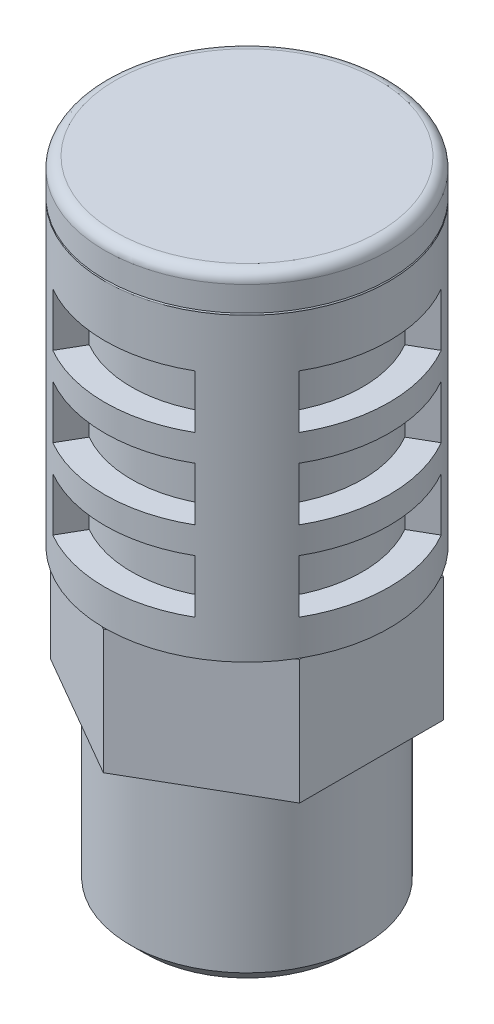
ISO-10303-21;
HEADER;
FILE_DESCRIPTION(('STEP AP214'),'2;1');
FILE_NAME('part.step','',(''),(''),'','','');
FILE_SCHEMA(('AUTOMOTIVE_DESIGN { 1 0 10303 214 1 1 1 1 }'));
ENDSEC;
DATA;
#1=APPLICATION_CONTEXT('core data for automotive mechanical design processes');
#2=APPLICATION_PROTOCOL_DEFINITION('international standard','automotive_design',2000,#1);
#3=PRODUCT_CONTEXT('',#1,'mechanical');
#4=PRODUCT('Part','Part','',(#3));
#5=PRODUCT_RELATED_PRODUCT_CATEGORY('part','',(#4));
#6=PRODUCT_DEFINITION_FORMATION('','',#4);
#7=PRODUCT_DEFINITION_CONTEXT('part definition',#1,'design');
#8=PRODUCT_DEFINITION('design','',#6,#7);
#9=PRODUCT_DEFINITION_SHAPE('','',#8);
#10=(LENGTH_UNIT() NAMED_UNIT(*) SI_UNIT(.MILLI.,.METRE.));
#11=(NAMED_UNIT(*) PLANE_ANGLE_UNIT() SI_UNIT($,.RADIAN.));
#12=(NAMED_UNIT(*) SI_UNIT($,.STERADIAN.) SOLID_ANGLE_UNIT());
#13=UNCERTAINTY_MEASURE_WITH_UNIT(LENGTH_MEASURE(1.E-05),#10,'distance_accuracy_value','');
#14=(GEOMETRIC_REPRESENTATION_CONTEXT(3) GLOBAL_UNCERTAINTY_ASSIGNED_CONTEXT((#13)) GLOBAL_UNIT_ASSIGNED_CONTEXT((#10,
#11,#12)) REPRESENTATION_CONTEXT('',''));
#15=CARTESIAN_POINT('',(0.,0.,0.));
#16=DIRECTION('',(0.,0.,1.));
#17=DIRECTION('',(1.,0.,0.));
#18=AXIS2_PLACEMENT_3D('',#15,#16,#17);
#19=CARTESIAN_POINT('',(7.99999999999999,17.,0.));
#20=DIRECTION('',(0.,-1.,0.));
#21=DIRECTION('',(1.,0.,0.));
#22=AXIS2_PLACEMENT_3D('',#19,#20,#21);
#23=PLANE('',#22);
#24=CARTESIAN_POINT('',(0.,17.,0.));
#25=DIRECTION('',(0.,1.,0.));
#26=DIRECTION('',(-1.,0.,0.));
#27=AXIS2_PLACEMENT_3D('',#24,#25,#26);
#28=CIRCLE('',#27,8.00000000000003);
#29=CARTESIAN_POINT('',(-7.,17.,3.87298334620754));
#30=VERTEX_POINT('',#29);
#31=CARTESIAN_POINT('',(-6.85410196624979,17.,4.1256861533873));
#32=VERTEX_POINT('',#31);
#33=EDGE_CURVE('E447',#30,#32,#28,.T.);
#34=ORIENTED_EDGE('',*,*,#33,.F.);
#35=DIRECTION('',(0.,0.,1.));
#36=VECTOR('',#35,1.);
#37=CARTESIAN_POINT('',(-7.,17.,-4.04145188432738));
#38=LINE('',#37,#36);
#39=CARTESIAN_POINT('',(-7.,17.,4.04145188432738));
#40=VERTEX_POINT('',#39);
#41=EDGE_CURVE('E425',#30,#40,#38,.T.);
#42=ORIENTED_EDGE('',*,*,#41,.T.);
#43=DIRECTION('',(0.866025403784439,0.,0.5));
#44=VECTOR('',#43,1.);
#45=CARTESIAN_POINT('',(-7.,17.,4.04145188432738));
#46=LINE('',#45,#44);
#47=EDGE_CURVE('E437',#40,#32,#46,.T.);
#48=ORIENTED_EDGE('',*,*,#47,.T.);
#49=EDGE_LOOP('',(#34,#42,#48));
#50=FACE_BOUND('',#49,.T.);
#51=ADVANCED_FACE('F41',(#50),#23,.F.);
#52=CARTESIAN_POINT('',(-0.145898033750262,17.,7.99866949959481));
#53=VERTEX_POINT('',#52);
#54=CARTESIAN_POINT('',(0.145898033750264,17.,7.99866949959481));
#55=VERTEX_POINT('',#54);
#56=EDGE_CURVE('E817',#53,#55,#28,.T.);
#57=ORIENTED_EDGE('',*,*,#56,.F.);
#58=CARTESIAN_POINT('',(0.,17.,8.08290376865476));
#59=VERTEX_POINT('',#58);
#60=EDGE_CURVE('E446',#53,#59,#46,.T.);
#61=ORIENTED_EDGE('',*,*,#60,.T.);
#62=DIRECTION('',(0.866025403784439,0.,-0.5));
#63=VECTOR('',#62,1.);
#64=CARTESIAN_POINT('',(0.,17.,8.08290376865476));
#65=LINE('',#64,#63);
#66=EDGE_CURVE('E462',#59,#55,#65,.T.);
#67=ORIENTED_EDGE('',*,*,#66,.T.);
#68=EDGE_LOOP('',(#57,#61,#67));
#69=FACE_BOUND('',#68,.T.);
#70=ADVANCED_FACE('F940',(#69),#23,.F.);
#71=CARTESIAN_POINT('',(6.85410196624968,17.,4.12568615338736));
#72=VERTEX_POINT('',#71);
#73=CARTESIAN_POINT('',(7.,17.,3.87298334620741));
#74=VERTEX_POINT('',#73);
#75=EDGE_CURVE('E1217',#72,#74,#28,.T.);
#76=ORIENTED_EDGE('',*,*,#75,.F.);
#77=CARTESIAN_POINT('',(7.,17.,4.04145188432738));
#78=VERTEX_POINT('',#77);
#79=EDGE_CURVE('E444',#72,#78,#65,.T.);
#80=ORIENTED_EDGE('',*,*,#79,.T.);
#81=DIRECTION('',(0.,0.,-1.));
#82=VECTOR('',#81,1.);
#83=CARTESIAN_POINT('',(7.,17.,4.04145188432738));
#84=LINE('',#83,#82);
#85=EDGE_CURVE('E466',#78,#74,#84,.T.);
#86=ORIENTED_EDGE('',*,*,#85,.T.);
#87=EDGE_LOOP('',(#76,#80,#86));
#88=FACE_BOUND('',#87,.T.);
#89=ADVANCED_FACE('F946',(#88),#23,.F.);
#90=CARTESIAN_POINT('',(7.,17.,-3.87298334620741));
#91=VERTEX_POINT('',#90);
#92=CARTESIAN_POINT('',(6.85410196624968,17.,-4.12568615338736));
#93=VERTEX_POINT('',#92);
#94=EDGE_CURVE('E978',#91,#93,#28,.T.);
#95=ORIENTED_EDGE('',*,*,#94,.F.);
#96=CARTESIAN_POINT('',(7.,17.,-4.04145188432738));
#97=VERTEX_POINT('',#96);
#98=EDGE_CURVE('E464',#91,#97,#84,.T.);
#99=ORIENTED_EDGE('',*,*,#98,.T.);
#100=DIRECTION('',(-0.866025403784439,0.,-0.5));
#101=VECTOR('',#100,1.);
#102=CARTESIAN_POINT('',(7.,17.,-4.04145188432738));
#103=LINE('',#102,#101);
#104=EDGE_CURVE('E471',#97,#93,#103,.T.);
#105=ORIENTED_EDGE('',*,*,#104,.T.);
#106=EDGE_LOOP('',(#95,#99,#105));
#107=FACE_BOUND('',#106,.T.);
#108=ADVANCED_FACE('F961',(#107),#23,.F.);
#109=CARTESIAN_POINT('',(0.145898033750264,17.,-7.99866949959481));
#110=VERTEX_POINT('',#109);
#111=CARTESIAN_POINT('',(-0.145898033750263,17.,-7.99866949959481));
#112=VERTEX_POINT('',#111);
#113=EDGE_CURVE('E973',#110,#112,#28,.T.);
#114=ORIENTED_EDGE('',*,*,#113,.F.);
#115=CARTESIAN_POINT('',(0.,17.,-8.08290376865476));
#116=VERTEX_POINT('',#115);
#117=EDGE_CURVE('E469',#110,#116,#103,.T.);
#118=ORIENTED_EDGE('',*,*,#117,.T.);
#119=DIRECTION('',(-0.866025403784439,0.,0.5));
#120=VECTOR('',#119,1.);
#121=CARTESIAN_POINT('',(0.,17.,-8.08290376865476));
#122=LINE('',#121,#120);
#123=EDGE_CURVE('E476',#116,#112,#122,.T.);
#124=ORIENTED_EDGE('',*,*,#123,.T.);
#125=EDGE_LOOP('',(#114,#118,#124));
#126=FACE_BOUND('',#125,.T.);
#127=ADVANCED_FACE('F951',(#126),#23,.F.);
#128=CARTESIAN_POINT('',(0.,36.,0.));
#129=DIRECTION('',(0.,-1.,0.));
#130=DIRECTION('',(1.,0.,0.));
#131=AXIS2_PLACEMENT_3D('',#128,#129,#130);
#132=PLANE('',#131);
#133=CARTESIAN_POINT('',(0.,36.,0.));
#134=DIRECTION('',(0.,1.,0.));
#135=DIRECTION('',(-1.,0.,0.));
#136=AXIS2_PLACEMENT_3D('',#133,#134,#135);
#137=CIRCLE('',#136,7.39999999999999);
#138=CARTESIAN_POINT('',(-7.39999999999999,36.,0.));
#139=VERTEX_POINT('',#138);
#140=EDGE_CURVE('E829',#139,#139,#137,.T.);
#141=ORIENTED_EDGE('',*,*,#140,.T.);
#142=EDGE_LOOP('',(#141));
#143=FACE_BOUND('',#142,.T.);
#144=ADVANCED_FACE('F43',(#143),#132,.F.);
#145=CARTESIAN_POINT('',(0.,35.4,0.));
#146=DIRECTION('',(0.,1.,0.));
#147=DIRECTION('',(-1.,0.,0.));
#148=AXIS2_PLACEMENT_3D('',#145,#146,#147);
#149=TOROIDAL_SURFACE('',#148,7.39999999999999,0.600000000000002);
#150=ORIENTED_EDGE('',*,*,#140,.F.);
#151=EDGE_LOOP('',(#150));
#152=FACE_BOUND('',#151,.T.);
#153=CARTESIAN_POINT('',(0.,35.4,0.));
#154=DIRECTION('',(0.,1.,0.));
#155=DIRECTION('',(-1.,0.,0.));
#156=AXIS2_PLACEMENT_3D('',#153,#154,#155);
#157=CIRCLE('',#156,7.99999999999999);
#158=CARTESIAN_POINT('',(-7.99999999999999,35.4,0.));
#159=VERTEX_POINT('',#158);
#160=EDGE_CURVE('E826',#159,#159,#157,.T.);
#161=ORIENTED_EDGE('',*,*,#160,.T.);
#162=EDGE_LOOP('',(#161));
#163=FACE_BOUND('',#162,.T.);
#164=ADVANCED_FACE('F967',(#152,#163),#149,.T.);
#165=CARTESIAN_POINT('',(0.,0.,0.));
#166=DIRECTION('',(0.,1.,0.));
#167=DIRECTION('',(-1.,0.,0.));
#168=AXIS2_PLACEMENT_3D('',#165,#166,#167);
#169=CYLINDRICAL_SURFACE('',#168,8.);
#170=ORIENTED_EDGE('',*,*,#160,.F.);
#171=EDGE_LOOP('',(#170));
#172=FACE_BOUND('',#171,.T.);
#173=CARTESIAN_POINT('',(0.,34.,0.));
#174=DIRECTION('',(0.,1.,0.));
#175=DIRECTION('',(-1.,0.,0.));
#176=AXIS2_PLACEMENT_3D('',#173,#174,#175);
#177=CIRCLE('',#176,7.99999999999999);
#178=CARTESIAN_POINT('',(-7.99999999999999,34.,0.));
#179=VERTEX_POINT('',#178);
#180=EDGE_CURVE('E823',#179,#179,#177,.T.);
#181=ORIENTED_EDGE('',*,*,#180,.T.);
#182=EDGE_LOOP('',(#181));
#183=FACE_BOUND('',#182,.T.);
#184=ADVANCED_FACE('F1714',(#172,#183),#169,.T.);
#185=CARTESIAN_POINT('',(8.,34.,0.));
#186=DIRECTION('',(0.,1.,0.));
#187=DIRECTION('',(-1.,0.,0.));
#188=AXIS2_PLACEMENT_3D('',#185,#186,#187);
#189=PLANE('',#188);
#190=ORIENTED_EDGE('',*,*,#180,.F.);
#191=EDGE_LOOP('',(#190));
#192=FACE_BOUND('',#191,.T.);
#193=CARTESIAN_POINT('',(0.,34.,0.));
#194=DIRECTION('',(0.,1.,0.));
#195=DIRECTION('',(-1.,0.,0.));
#196=AXIS2_PLACEMENT_3D('',#193,#194,#195);
#197=CIRCLE('',#196,7.9);
#198=CARTESIAN_POINT('',(-7.89999999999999,34.,0.));
#199=VERTEX_POINT('',#198);
#200=EDGE_CURVE('E820',#199,#199,#197,.T.);
#201=ORIENTED_EDGE('',*,*,#200,.T.);
#202=EDGE_LOOP('',(#201));
#203=FACE_BOUND('',#202,.T.);
#204=ADVANCED_FACE('F1702',(#192,#203),#189,.F.);
#205=CARTESIAN_POINT('',(0.,33.9,0.));
#206=DIRECTION('',(0.,1.,0.));
#207=DIRECTION('',(-1.,0.,0.));
#208=AXIS2_PLACEMENT_3D('',#205,#206,#207);
#209=TOROIDAL_SURFACE('',#208,7.9,0.0999999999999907);
#210=ORIENTED_EDGE('',*,*,#200,.F.);
#211=EDGE_LOOP('',(#210));
#212=FACE_BOUND('',#211,.T.);
#213=CARTESIAN_POINT('',(0.,33.9,0.));
#214=DIRECTION('',(0.,1.,0.));
#215=DIRECTION('',(-1.,0.,0.));
#216=AXIS2_PLACEMENT_3D('',#213,#214,#215);
#217=CIRCLE('',#216,7.99999999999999);
#218=CARTESIAN_POINT('',(-7.99999999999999,33.9,0.));
#219=VERTEX_POINT('',#218);
#220=EDGE_CURVE('E816',#219,#219,#217,.T.);
#221=ORIENTED_EDGE('',*,*,#220,.T.);
#222=EDGE_LOOP('',(#221));
#223=FACE_BOUND('',#222,.T.);
#224=ADVANCED_FACE('F959',(#212,#223),#209,.T.);
#225=CARTESIAN_POINT('',(0.,0.,0.));
#226=DIRECTION('',(0.,1.,0.));
#227=DIRECTION('',(-1.,0.,0.));
#228=AXIS2_PLACEMENT_3D('',#225,#226,#227);
#229=CYLINDRICAL_SURFACE('',#228,8.00000000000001);
#230=CARTESIAN_POINT('',(0.,26.5,0.));
#231=DIRECTION('',(0.,-1.,0.));
#232=DIRECTION('',(0.,0.,-1.));
#233=AXIS2_PLACEMENT_3D('',#230,#231,#232);
#234=CIRCLE('',#233,8.);
#235=CARTESIAN_POINT('',(4.,26.5,6.92820323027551));
#236=VERTEX_POINT('',#235);
#237=CARTESIAN_POINT('',(-3.99999999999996,26.5,6.92820323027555));
#238=VERTEX_POINT('',#237);
#239=EDGE_CURVE('E559',#236,#238,#234,.T.);
#240=ORIENTED_EDGE('',*,*,#239,.F.);
#241=DIRECTION('',(0.,1.,0.));
#242=VECTOR('',#241,1.);
#243=CARTESIAN_POINT('',(3.99999999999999,0.,6.92820323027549));
#244=LINE('',#243,#242);
#245=CARTESIAN_POINT('',(4.,23.5,6.92820323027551));
#246=VERTEX_POINT('',#245);
#247=EDGE_CURVE('E50',#236,#246,#244,.F.);
#248=ORIENTED_EDGE('',*,*,#247,.T.);
#249=CARTESIAN_POINT('',(0.,23.5,0.));
#250=DIRECTION('',(0.,-1.,0.));
#251=DIRECTION('',(0.,0.,-1.));
#252=AXIS2_PLACEMENT_3D('',#249,#250,#251);
#253=CIRCLE('',#252,8.);
#254=CARTESIAN_POINT('',(-4.,23.5,6.92820323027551));
#255=VERTEX_POINT('',#254);
#256=EDGE_CURVE('E566',#246,#255,#253,.T.);
#257=ORIENTED_EDGE('',*,*,#256,.T.);
#258=DIRECTION('',(0.,1.,0.));
#259=VECTOR('',#258,1.);
#260=CARTESIAN_POINT('',(-4.00000000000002,0.,6.92820323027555));
#261=LINE('',#260,#259);
#262=EDGE_CURVE('E876',#238,#255,#261,.F.);
#263=ORIENTED_EDGE('',*,*,#262,.F.);
#264=EDGE_LOOP('',(#240,#248,#257,#263));
#265=FACE_BOUND('',#264,.T.);
#266=CARTESIAN_POINT('',(0.,22.,0.));
#267=DIRECTION('',(0.,-1.,0.));
#268=DIRECTION('',(0.,0.,-1.));
#269=AXIS2_PLACEMENT_3D('',#266,#267,#268);
#270=CIRCLE('',#269,8.);
#271=CARTESIAN_POINT('',(4.,22.,6.92820323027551));
#272=VERTEX_POINT('',#271);
#273=CARTESIAN_POINT('',(-3.99999999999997,22.,6.92820323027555));
#274=VERTEX_POINT('',#273);
#275=EDGE_CURVE('E569',#272,#274,#270,.T.);
#276=ORIENTED_EDGE('',*,*,#275,.F.);
#277=CARTESIAN_POINT('',(4.,19.,6.92820323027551));
#278=VERTEX_POINT('',#277);
#279=EDGE_CURVE('E45',#272,#278,#244,.F.);
#280=ORIENTED_EDGE('',*,*,#279,.T.);
#281=CARTESIAN_POINT('',(0.,19.,0.));
#282=DIRECTION('',(0.,1.,0.));
#283=DIRECTION('',(0.,0.,1.));
#284=AXIS2_PLACEMENT_3D('',#281,#282,#283);
#285=CIRCLE('',#284,8.00000000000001);
#286=CARTESIAN_POINT('',(-4.00000000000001,19.,6.92820323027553));
#287=VERTEX_POINT('',#286);
#288=EDGE_CURVE('E878',#287,#278,#285,.T.);
#289=ORIENTED_EDGE('',*,*,#288,.F.);
#290=EDGE_CURVE('E874',#274,#287,#261,.F.);
#291=ORIENTED_EDGE('',*,*,#290,.F.);
#292=EDGE_LOOP('',(#276,#280,#289,#291));
#293=FACE_BOUND('',#292,.T.);
#294=CARTESIAN_POINT('',(0.,31.,0.));
#295=DIRECTION('',(0.,-1.,0.));
#296=DIRECTION('',(0.,0.,-1.));
#297=AXIS2_PLACEMENT_3D('',#294,#295,#296);
#298=CIRCLE('',#297,8.00000000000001);
#299=CARTESIAN_POINT('',(4.,31.,6.92820323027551));
#300=VERTEX_POINT('',#299);
#301=CARTESIAN_POINT('',(-3.99999999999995,31.,6.92820323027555));
#302=VERTEX_POINT('',#301);
#303=EDGE_CURVE('E879',#300,#302,#298,.T.);
#304=ORIENTED_EDGE('',*,*,#303,.F.);
#305=CARTESIAN_POINT('',(4.,28.,6.9282032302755));
#306=VERTEX_POINT('',#305);
#307=EDGE_CURVE('E11',#300,#306,#244,.F.);
#308=ORIENTED_EDGE('',*,*,#307,.T.);
#309=CARTESIAN_POINT('',(0.,28.,0.));
#310=DIRECTION('',(0.,-1.,0.));
#311=DIRECTION('',(0.,0.,-1.));
#312=AXIS2_PLACEMENT_3D('',#309,#310,#311);
#313=CIRCLE('',#312,7.99999999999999);
#314=CARTESIAN_POINT('',(-3.99999999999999,28.,6.9282032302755));
#315=VERTEX_POINT('',#314);
#316=EDGE_CURVE('E556',#306,#315,#313,.T.);
#317=ORIENTED_EDGE('',*,*,#316,.T.);
#318=EDGE_CURVE('E877',#302,#315,#261,.F.);
#319=ORIENTED_EDGE('',*,*,#318,.F.);
#320=EDGE_LOOP('',(#304,#308,#317,#319));
#321=FACE_BOUND('',#320,.T.);
#322=CARTESIAN_POINT('',(0.,23.5,0.));
#323=DIRECTION('',(0.,1.,0.));
#324=DIRECTION('',(0.,0.,1.));
#325=AXIS2_PLACEMENT_3D('',#322,#323,#324);
#326=CIRCLE('',#325,8.);
#327=CARTESIAN_POINT('',(4.,23.5,-6.92820323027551));
#328=VERTEX_POINT('',#327);
#329=CARTESIAN_POINT('',(-3.99999999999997,23.5,-6.92820323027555));
#330=VERTEX_POINT('',#329);
#331=EDGE_CURVE('E636',#328,#330,#326,.T.);
#332=ORIENTED_EDGE('',*,*,#331,.F.);
#333=DIRECTION('',(0.,1.,0.));
#334=VECTOR('',#333,1.);
#335=CARTESIAN_POINT('',(3.99999999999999,0.,-6.92820323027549));
#336=LINE('',#335,#334);
#337=CARTESIAN_POINT('',(4.,26.5,-6.92820323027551));
#338=VERTEX_POINT('',#337);
#339=EDGE_CURVE('E872',#328,#338,#336,.T.);
#340=ORIENTED_EDGE('',*,*,#339,.T.);
#341=CARTESIAN_POINT('',(0.,26.5,0.));
#342=DIRECTION('',(0.,1.,0.));
#343=DIRECTION('',(0.,0.,1.));
#344=AXIS2_PLACEMENT_3D('',#341,#342,#343);
#345=CIRCLE('',#344,8.);
#346=CARTESIAN_POINT('',(-4.,26.5,-6.92820323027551));
#347=VERTEX_POINT('',#346);
#348=EDGE_CURVE('E643',#338,#347,#345,.T.);
#349=ORIENTED_EDGE('',*,*,#348,.T.);
#350=DIRECTION('',(0.,1.,0.));
#351=VECTOR('',#350,1.);
#352=CARTESIAN_POINT('',(-4.00000000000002,0.,-6.92820323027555));
#353=LINE('',#352,#351);
#354=EDGE_CURVE('E862',#330,#347,#353,.T.);
#355=ORIENTED_EDGE('',*,*,#354,.F.);
#356=EDGE_LOOP('',(#332,#340,#349,#355));
#357=FACE_BOUND('',#356,.T.);
#358=CARTESIAN_POINT('',(0.,28.,0.));
#359=DIRECTION('',(0.,1.,0.));
#360=DIRECTION('',(0.,0.,1.));
#361=AXIS2_PLACEMENT_3D('',#358,#359,#360);
#362=CIRCLE('',#361,7.99999999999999);
#363=CARTESIAN_POINT('',(4.,28.,-6.9282032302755));
#364=VERTEX_POINT('',#363);
#365=CARTESIAN_POINT('',(-3.99999999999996,28.,-6.92820323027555));
#366=VERTEX_POINT('',#365);
#367=EDGE_CURVE('E646',#364,#366,#362,.T.);
#368=ORIENTED_EDGE('',*,*,#367,.F.);
#369=CARTESIAN_POINT('',(4.,31.,-6.92820323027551));
#370=VERTEX_POINT('',#369);
#371=EDGE_CURVE('E869',#364,#370,#336,.T.);
#372=ORIENTED_EDGE('',*,*,#371,.T.);
#373=CARTESIAN_POINT('',(0.,31.,0.));
#374=DIRECTION('',(0.,-1.,0.));
#375=DIRECTION('',(0.,0.,-1.));
#376=AXIS2_PLACEMENT_3D('',#373,#374,#375);
#377=CIRCLE('',#376,8.00000000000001);
#378=CARTESIAN_POINT('',(-4.00000000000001,31.,-6.92820323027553));
#379=VERTEX_POINT('',#378);
#380=EDGE_CURVE('E864',#379,#370,#377,.T.);
#381=ORIENTED_EDGE('',*,*,#380,.F.);
#382=EDGE_CURVE('E860',#366,#379,#353,.T.);
#383=ORIENTED_EDGE('',*,*,#382,.F.);
#384=EDGE_LOOP('',(#368,#372,#381,#383));
#385=FACE_BOUND('',#384,.T.);
#386=CARTESIAN_POINT('',(0.,19.,0.));
#387=DIRECTION('',(0.,1.,0.));
#388=DIRECTION('',(0.,0.,1.));
#389=AXIS2_PLACEMENT_3D('',#386,#387,#388);
#390=CIRCLE('',#389,8.00000000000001);
#391=CARTESIAN_POINT('',(4.,19.,-6.92820323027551));
#392=VERTEX_POINT('',#391);
#393=CARTESIAN_POINT('',(-3.99999999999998,19.,-6.92820323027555));
#394=VERTEX_POINT('',#393);
#395=EDGE_CURVE('E866',#392,#394,#390,.T.);
#396=ORIENTED_EDGE('',*,*,#395,.F.);
#397=CARTESIAN_POINT('',(4.,22.,-6.92820323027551));
#398=VERTEX_POINT('',#397);
#399=EDGE_CURVE('E873',#392,#398,#336,.T.);
#400=ORIENTED_EDGE('',*,*,#399,.T.);
#401=CARTESIAN_POINT('',(0.,22.,0.));
#402=DIRECTION('',(0.,1.,0.));
#403=DIRECTION('',(0.,0.,1.));
#404=AXIS2_PLACEMENT_3D('',#401,#402,#403);
#405=CIRCLE('',#404,8.);
#406=CARTESIAN_POINT('',(-4.,22.,-6.92820323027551));
#407=VERTEX_POINT('',#406);
#408=EDGE_CURVE('E633',#398,#407,#405,.T.);
#409=ORIENTED_EDGE('',*,*,#408,.T.);
#410=EDGE_CURVE('E863',#394,#407,#353,.T.);
#411=ORIENTED_EDGE('',*,*,#410,.F.);
#412=EDGE_LOOP('',(#396,#400,#409,#411));
#413=FACE_BOUND('',#412,.T.);
#414=CARTESIAN_POINT('',(0.,26.5,0.));
#415=DIRECTION('',(0.,-1.,0.));
#416=DIRECTION('',(1.,0.,0.));
#417=AXIS2_PLACEMENT_3D('',#414,#415,#416);
#418=CIRCLE('',#417,8.);
#419=CARTESIAN_POINT('',(-6.92820323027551,26.5,4.));
#420=VERTEX_POINT('',#419);
#421=CARTESIAN_POINT('',(-6.92820323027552,26.5,-4.00000000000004));
#422=VERTEX_POINT('',#421);
#423=EDGE_CURVE('E707',#420,#422,#418,.T.);
#424=ORIENTED_EDGE('',*,*,#423,.F.);
#425=DIRECTION('',(0.,1.,0.));
#426=VECTOR('',#425,1.);
#427=CARTESIAN_POINT('',(-6.92820323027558,0.,4.00000000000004));
#428=LINE('',#427,#426);
#429=CARTESIAN_POINT('',(-6.92820323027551,23.5,4.));
#430=VERTEX_POINT('',#429);
#431=EDGE_CURVE('E858',#420,#430,#428,.F.);
#432=ORIENTED_EDGE('',*,*,#431,.T.);
#433=CARTESIAN_POINT('',(0.,23.5,0.));
#434=DIRECTION('',(0.,-1.,0.));
#435=DIRECTION('',(1.,0.,0.));
#436=AXIS2_PLACEMENT_3D('',#433,#434,#435);
#437=CIRCLE('',#436,8.);
#438=CARTESIAN_POINT('',(-6.92820323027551,23.5,-4.));
#439=VERTEX_POINT('',#438);
#440=EDGE_CURVE('E714',#430,#439,#437,.T.);
#441=ORIENTED_EDGE('',*,*,#440,.T.);
#442=DIRECTION('',(0.,1.,0.));
#443=VECTOR('',#442,1.);
#444=CARTESIAN_POINT('',(-6.92820323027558,0.,-4.00000000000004));
#445=LINE('',#444,#443);
#446=EDGE_CURVE('E848',#422,#439,#445,.F.);
#447=ORIENTED_EDGE('',*,*,#446,.F.);
#448=EDGE_LOOP('',(#424,#432,#441,#447));
#449=FACE_BOUND('',#448,.T.);
#450=CARTESIAN_POINT('',(0.,22.,0.));
#451=DIRECTION('',(0.,-1.,0.));
#452=DIRECTION('',(1.,0.,0.));
#453=AXIS2_PLACEMENT_3D('',#450,#451,#452);
#454=CIRCLE('',#453,8.);
#455=CARTESIAN_POINT('',(-6.92820323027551,22.,4.));
#456=VERTEX_POINT('',#455);
#457=CARTESIAN_POINT('',(-6.92820323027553,22.,-4.00000000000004));
#458=VERTEX_POINT('',#457);
#459=EDGE_CURVE('E717',#456,#458,#454,.T.);
#460=ORIENTED_EDGE('',*,*,#459,.F.);
#461=CARTESIAN_POINT('',(-6.92820323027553,19.,4.00000000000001));
#462=VERTEX_POINT('',#461);
#463=EDGE_CURVE('E855',#456,#462,#428,.F.);
#464=ORIENTED_EDGE('',*,*,#463,.T.);
#465=CARTESIAN_POINT('',(0.,19.,0.));
#466=DIRECTION('',(0.,1.,0.));
#467=DIRECTION('',(-1.,0.,0.));
#468=AXIS2_PLACEMENT_3D('',#465,#466,#467);
#469=CIRCLE('',#468,8.00000000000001);
#470=CARTESIAN_POINT('',(-6.92820323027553,19.,-4.00000000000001));
#471=VERTEX_POINT('',#470);
#472=EDGE_CURVE('E850',#471,#462,#469,.T.);
#473=ORIENTED_EDGE('',*,*,#472,.F.);
#474=EDGE_CURVE('E846',#458,#471,#445,.F.);
#475=ORIENTED_EDGE('',*,*,#474,.F.);
#476=EDGE_LOOP('',(#460,#464,#473,#475));
#477=FACE_BOUND('',#476,.T.);
#478=CARTESIAN_POINT('',(0.,31.,0.));
#479=DIRECTION('',(0.,-1.,0.));
#480=DIRECTION('',(1.,0.,0.));
#481=AXIS2_PLACEMENT_3D('',#478,#479,#480);
#482=CIRCLE('',#481,8.00000000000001);
#483=CARTESIAN_POINT('',(-6.92820323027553,31.,4.00000000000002));
#484=VERTEX_POINT('',#483);
#485=CARTESIAN_POINT('',(-6.92820323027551,31.,-4.00000000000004));
#486=VERTEX_POINT('',#485);
#487=EDGE_CURVE('E852',#484,#486,#482,.T.);
#488=ORIENTED_EDGE('',*,*,#487,.F.);
#489=CARTESIAN_POINT('',(-6.9282032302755,28.,4.));
#490=VERTEX_POINT('',#489);
#491=EDGE_CURVE('E859',#484,#490,#428,.F.);
#492=ORIENTED_EDGE('',*,*,#491,.T.);
#493=CARTESIAN_POINT('',(0.,28.,0.));
#494=DIRECTION('',(0.,-1.,0.));
#495=DIRECTION('',(1.,0.,0.));
#496=AXIS2_PLACEMENT_3D('',#493,#494,#495);
#497=CIRCLE('',#496,7.99999999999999);
#498=CARTESIAN_POINT('',(-6.9282032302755,28.,-3.99999999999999));
#499=VERTEX_POINT('',#498);
#500=EDGE_CURVE('E704',#490,#499,#497,.T.);
#501=ORIENTED_EDGE('',*,*,#500,.T.);
#502=EDGE_CURVE('E849',#486,#499,#445,.F.);
#503=ORIENTED_EDGE('',*,*,#502,.F.);
#504=EDGE_LOOP('',(#488,#492,#501,#503));
#505=FACE_BOUND('',#504,.T.);
#506=CARTESIAN_POINT('',(0.,23.5,0.));
#507=DIRECTION('',(0.,1.,0.));
#508=DIRECTION('',(-1.,0.,0.));
#509=AXIS2_PLACEMENT_3D('',#506,#507,#508);
#510=CIRCLE('',#509,8.);
#511=CARTESIAN_POINT('',(6.92820323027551,23.5,4.));
#512=VERTEX_POINT('',#511);
#513=CARTESIAN_POINT('',(6.92820323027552,23.5,-3.99999999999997));
#514=VERTEX_POINT('',#513);
#515=EDGE_CURVE('E784',#512,#514,#510,.T.);
#516=ORIENTED_EDGE('',*,*,#515,.F.);
#517=DIRECTION('',(0.,1.,0.));
#518=VECTOR('',#517,1.);
#519=CARTESIAN_POINT('',(6.92820323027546,0.,3.99999999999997));
#520=LINE('',#519,#518);
#521=CARTESIAN_POINT('',(6.92820323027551,26.5,4.));
#522=VERTEX_POINT('',#521);
#523=EDGE_CURVE('E844',#512,#522,#520,.T.);
#524=ORIENTED_EDGE('',*,*,#523,.T.);
#525=CARTESIAN_POINT('',(0.,26.5,0.));
#526=DIRECTION('',(0.,1.,0.));
#527=DIRECTION('',(-1.,0.,0.));
#528=AXIS2_PLACEMENT_3D('',#525,#526,#527);
#529=CIRCLE('',#528,8.);
#530=CARTESIAN_POINT('',(6.92820323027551,26.5,-4.));
#531=VERTEX_POINT('',#530);
#532=EDGE_CURVE('E791',#522,#531,#529,.T.);
#533=ORIENTED_EDGE('',*,*,#532,.T.);
#534=DIRECTION('',(0.,1.,0.));
#535=VECTOR('',#534,1.);
#536=CARTESIAN_POINT('',(6.92820323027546,0.,-3.99999999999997));
#537=LINE('',#536,#535);
#538=EDGE_CURVE('E834',#514,#531,#537,.T.);
#539=ORIENTED_EDGE('',*,*,#538,.F.);
#540=EDGE_LOOP('',(#516,#524,#533,#539));
#541=FACE_BOUND('',#540,.T.);
#542=CARTESIAN_POINT('',(0.,28.,0.));
#543=DIRECTION('',(0.,1.,0.));
#544=DIRECTION('',(-1.,0.,0.));
#545=AXIS2_PLACEMENT_3D('',#542,#543,#544);
#546=CIRCLE('',#545,7.99999999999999);
#547=CARTESIAN_POINT('',(6.9282032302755,28.,4.));
#548=VERTEX_POINT('',#547);
#549=CARTESIAN_POINT('',(6.92820323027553,28.,-3.99999999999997));
#550=VERTEX_POINT('',#549);
#551=EDGE_CURVE('E794',#548,#550,#546,.T.);
#552=ORIENTED_EDGE('',*,*,#551,.F.);
#553=CARTESIAN_POINT('',(6.92820323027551,31.,4.));
#554=VERTEX_POINT('',#553);
#555=EDGE_CURVE('E841',#548,#554,#520,.T.);
#556=ORIENTED_EDGE('',*,*,#555,.T.);
#557=CARTESIAN_POINT('',(0.,31.,0.));
#558=DIRECTION('',(0.,-1.,0.));
#559=DIRECTION('',(1.,0.,0.));
#560=AXIS2_PLACEMENT_3D('',#557,#558,#559);
#561=CIRCLE('',#560,8.00000000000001);
#562=CARTESIAN_POINT('',(6.92820323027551,31.,-4.));
#563=VERTEX_POINT('',#562);
#564=EDGE_CURVE('E836',#563,#554,#561,.T.);
#565=ORIENTED_EDGE('',*,*,#564,.F.);
#566=EDGE_CURVE('E832',#550,#563,#537,.T.);
#567=ORIENTED_EDGE('',*,*,#566,.F.);
#568=EDGE_LOOP('',(#552,#556,#565,#567));
#569=FACE_BOUND('',#568,.T.);
#570=CARTESIAN_POINT('',(0.,19.,0.));
#571=DIRECTION('',(0.,1.,0.));
#572=DIRECTION('',(-1.,0.,0.));
#573=AXIS2_PLACEMENT_3D('',#570,#571,#572);
#574=CIRCLE('',#573,8.00000000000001);
#575=CARTESIAN_POINT('',(6.92820323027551,19.,4.));
#576=VERTEX_POINT('',#575);
#577=CARTESIAN_POINT('',(6.92820323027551,19.,-3.99999999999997));
#578=VERTEX_POINT('',#577);
#579=EDGE_CURVE('E838',#576,#578,#574,.T.);
#580=ORIENTED_EDGE('',*,*,#579,.F.);
#581=CARTESIAN_POINT('',(6.92820323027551,22.,4.));
#582=VERTEX_POINT('',#581);
#583=EDGE_CURVE('E845',#576,#582,#520,.T.);
#584=ORIENTED_EDGE('',*,*,#583,.T.);
#585=CARTESIAN_POINT('',(0.,22.,0.));
#586=DIRECTION('',(0.,1.,0.));
#587=DIRECTION('',(-1.,0.,0.));
#588=AXIS2_PLACEMENT_3D('',#585,#586,#587);
#589=CIRCLE('',#588,8.);
#590=CARTESIAN_POINT('',(6.92820323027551,22.,-4.));
#591=VERTEX_POINT('',#590);
#592=EDGE_CURVE('E781',#582,#591,#589,.T.);
#593=ORIENTED_EDGE('',*,*,#592,.T.);
#594=EDGE_CURVE('E835',#578,#591,#537,.T.);
#595=ORIENTED_EDGE('',*,*,#594,.F.);
#596=EDGE_LOOP('',(#580,#584,#593,#595));
#597=FACE_BOUND('',#596,.T.);
#598=ORIENTED_EDGE('',*,*,#220,.F.);
#599=EDGE_LOOP('',(#598));
#600=FACE_BOUND('',#599,.T.);
#601=ORIENTED_EDGE('',*,*,#33,.T.);
#602=CARTESIAN_POINT('',(0.,17.,0.));
#603=DIRECTION('',(0.,1.,0.));
#604=DIRECTION('',(0.,0.,1.));
#605=AXIS2_PLACEMENT_3D('',#602,#603,#604);
#606=CIRCLE('',#605,8.00000000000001);
#607=EDGE_CURVE('E432',#32,#53,#606,.T.);
#608=ORIENTED_EDGE('',*,*,#607,.T.);
#609=ORIENTED_EDGE('',*,*,#56,.T.);
#610=EDGE_CURVE('E502',#55,#72,#606,.T.);
#611=ORIENTED_EDGE('',*,*,#610,.T.);
#612=ORIENTED_EDGE('',*,*,#75,.T.);
#613=EDGE_CURVE('E986',#74,#91,#606,.T.);
#614=ORIENTED_EDGE('',*,*,#613,.T.);
#615=ORIENTED_EDGE('',*,*,#94,.T.);
#616=EDGE_CURVE('E980',#93,#110,#606,.T.);
#617=ORIENTED_EDGE('',*,*,#616,.T.);
#618=ORIENTED_EDGE('',*,*,#113,.T.);
#619=CARTESIAN_POINT('',(-6.85410196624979,17.,-4.1256861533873));
#620=VERTEX_POINT('',#619);
#621=EDGE_CURVE('E987',#112,#620,#606,.T.);
#622=ORIENTED_EDGE('',*,*,#621,.T.);
#623=CARTESIAN_POINT('',(-7.,17.,-3.87298334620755));
#624=VERTEX_POINT('',#623);
#625=EDGE_CURVE('E814',#620,#624,#28,.T.);
#626=ORIENTED_EDGE('',*,*,#625,.T.);
#627=EDGE_CURVE('E501',#624,#30,#606,.T.);
#628=ORIENTED_EDGE('',*,*,#627,.T.);
#629=EDGE_LOOP('',(#601,#608,#609,#611,#612,#614,#615,#617,#618,#622,#626,#628));
#630=FACE_BOUND('',#629,.T.);
#631=ADVANCED_FACE('F892',(#265,#293,#321,#357,#385,#413,#449,#477,#505,#541,#569,#597,#600,
#630),#229,.T.);
#632=CARTESIAN_POINT('',(-7.00000000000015,17.,-4.04145188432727));
#633=VERTEX_POINT('',#632);
#634=EDGE_CURVE('E474',#620,#633,#122,.T.);
#635=ORIENTED_EDGE('',*,*,#634,.T.);
#636=EDGE_CURVE('E57',#633,#624,#38,.T.);
#637=ORIENTED_EDGE('',*,*,#636,.T.);
#638=ORIENTED_EDGE('',*,*,#625,.F.);
#639=EDGE_LOOP('',(#635,#637,#638));
#640=FACE_BOUND('',#639,.T.);
#641=ADVANCED_FACE('F942',(#640),#23,.F.);
#642=CARTESIAN_POINT('',(0.,19.,0.));
#643=DIRECTION('',(0.,1.,0.));
#644=DIRECTION('',(-1.,0.,0.));
#645=AXIS2_PLACEMENT_3D('',#642,#643,#644);
#646=CYLINDRICAL_SURFACE('',#645,6.5);
#647=CARTESIAN_POINT('',(0.,28.,0.));
#648=DIRECTION('',(0.,1.,0.));
#649=DIRECTION('',(-1.,0.,0.));
#650=AXIS2_PLACEMENT_3D('',#647,#648,#649);
#651=CIRCLE('',#650,6.5);
#652=CARTESIAN_POINT('',(5.62916512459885,28.,3.25));
#653=VERTEX_POINT('',#652);
#654=CARTESIAN_POINT('',(5.62916512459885,28.,-3.25));
#655=VERTEX_POINT('',#654);
#656=EDGE_CURVE('E797',#653,#655,#651,.T.);
#657=ORIENTED_EDGE('',*,*,#656,.T.);
#658=DIRECTION('',(0.,-1.,0.));
#659=VECTOR('',#658,1.);
#660=CARTESIAN_POINT('',(5.62916512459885,31.,-3.25));
#661=LINE('',#660,#659);
#662=CARTESIAN_POINT('',(5.62916512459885,31.,-3.25));
#663=VERTEX_POINT('',#662);
#664=EDGE_CURVE('E725',#663,#655,#661,.T.);
#665=ORIENTED_EDGE('',*,*,#664,.F.);
#666=CARTESIAN_POINT('',(0.,31.,0.));
#667=DIRECTION('',(0.,1.,0.));
#668=DIRECTION('',(-1.,0.,0.));
#669=AXIS2_PLACEMENT_3D('',#666,#667,#668);
#670=CIRCLE('',#669,6.49999999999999);
#671=CARTESIAN_POINT('',(5.62916512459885,31.,3.25));
#672=VERTEX_POINT('',#671);
#673=EDGE_CURVE('E774',#672,#663,#670,.T.);
#674=ORIENTED_EDGE('',*,*,#673,.F.);
#675=DIRECTION('',(0.,-1.,0.));
#676=VECTOR('',#675,1.);
#677=CARTESIAN_POINT('',(5.62916512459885,31.,3.25));
#678=LINE('',#677,#676);
#679=EDGE_CURVE('E748',#672,#653,#678,.T.);
#680=ORIENTED_EDGE('',*,*,#679,.T.);
#681=EDGE_LOOP('',(#657,#665,#674,#680));
#682=FACE_BOUND('',#681,.T.);
#683=ADVANCED_FACE('F950',(#682),#646,.T.);
#684=CARTESIAN_POINT('',(0.,0.,0.));
#685=DIRECTION('',(-0.5,0.,0.866025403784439));
#686=DIRECTION('',(0.866025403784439,0.,0.5));
#687=AXIS2_PLACEMENT_3D('',#684,#685,#686);
#688=PLANE('',#687);
#689=DIRECTION('',(0.866025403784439,0.,0.5));
#690=VECTOR('',#689,1.);
#691=CARTESIAN_POINT('',(5.62916512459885,28.,3.25));
#692=LINE('',#691,#690);
#693=EDGE_CURVE('E751',#653,#548,#692,.T.);
#694=ORIENTED_EDGE('',*,*,#693,.F.);
#695=ORIENTED_EDGE('',*,*,#679,.F.);
#696=DIRECTION('',(-0.866025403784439,0.,-0.5));
#697=VECTOR('',#696,1.);
#698=CARTESIAN_POINT('',(13.856406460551,31.,8.));
#699=LINE('',#698,#697);
#700=EDGE_CURVE('E772',#554,#672,#699,.T.);
#701=ORIENTED_EDGE('',*,*,#700,.F.);
#702=ORIENTED_EDGE('',*,*,#555,.F.);
#703=EDGE_LOOP('',(#694,#695,#701,#702));
#704=FACE_BOUND('',#703,.T.);
#705=ADVANCED_FACE('F956',(#704),#688,.F.);
#706=CARTESIAN_POINT('',(0.,0.,0.));
#707=DIRECTION('',(0.5,0.,0.866025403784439));
#708=DIRECTION('',(0.866025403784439,0.,-0.5));
#709=AXIS2_PLACEMENT_3D('',#706,#707,#708);
#710=PLANE('',#709);
#711=ORIENTED_EDGE('',*,*,#566,.T.);
#712=DIRECTION('',(-0.866025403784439,0.,0.5));
#713=VECTOR('',#712,1.);
#714=CARTESIAN_POINT('',(13.856406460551,31.,-8.));
#715=LINE('',#714,#713);
#716=EDGE_CURVE('E746',#563,#663,#715,.T.);
#717=ORIENTED_EDGE('',*,*,#716,.T.);
#718=ORIENTED_EDGE('',*,*,#664,.T.);
#719=DIRECTION('',(0.866025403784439,0.,-0.5));
#720=VECTOR('',#719,1.);
#721=CARTESIAN_POINT('',(5.62916512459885,28.,-3.25));
#722=LINE('',#721,#720);
#723=EDGE_CURVE('E728',#655,#550,#722,.T.);
#724=ORIENTED_EDGE('',*,*,#723,.T.);
#725=EDGE_LOOP('',(#711,#717,#718,#724));
#726=FACE_BOUND('',#725,.T.);
#727=ADVANCED_FACE('F1135',(#726),#710,.T.);
#728=CARTESIAN_POINT('',(13.856406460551,31.,8.));
#729=DIRECTION('',(0.,-1.,0.));
#730=DIRECTION('',(1.,0.,0.));
#731=AXIS2_PLACEMENT_3D('',#728,#729,#730);
#732=PLANE('',#731);
#733=ORIENTED_EDGE('',*,*,#564,.T.);
#734=ORIENTED_EDGE('',*,*,#700,.T.);
#735=ORIENTED_EDGE('',*,*,#673,.T.);
#736=ORIENTED_EDGE('',*,*,#716,.F.);
#737=EDGE_LOOP('',(#733,#734,#735,#736));
#738=FACE_BOUND('',#737,.T.);
#739=ADVANCED_FACE('F1141',(#738),#732,.T.);
#740=CARTESIAN_POINT('',(5.62916512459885,28.,3.25));
#741=DIRECTION('',(0.,1.,0.));
#742=DIRECTION('',(-1.,0.,0.));
#743=AXIS2_PLACEMENT_3D('',#740,#741,#742);
#744=PLANE('',#743);
#745=ORIENTED_EDGE('',*,*,#551,.T.);
#746=ORIENTED_EDGE('',*,*,#723,.F.);
#747=ORIENTED_EDGE('',*,*,#656,.F.);
#748=ORIENTED_EDGE('',*,*,#693,.T.);
#749=EDGE_LOOP('',(#745,#746,#747,#748));
#750=FACE_BOUND('',#749,.T.);
#751=ADVANCED_FACE('F1144',(#750),#744,.T.);
#752=CARTESIAN_POINT('',(0.,19.,0.));
#753=DIRECTION('',(0.,1.,0.));
#754=DIRECTION('',(-1.,0.,0.));
#755=AXIS2_PLACEMENT_3D('',#752,#753,#754);
#756=CYLINDRICAL_SURFACE('',#755,6.5);
#757=CARTESIAN_POINT('',(0.,23.5,0.));
#758=DIRECTION('',(0.,1.,0.));
#759=DIRECTION('',(-1.,0.,0.));
#760=AXIS2_PLACEMENT_3D('',#757,#758,#759);
#761=CIRCLE('',#760,6.5);
#762=CARTESIAN_POINT('',(5.62916512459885,23.5,3.25));
#763=VERTEX_POINT('',#762);
#764=CARTESIAN_POINT('',(5.62916512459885,23.5,-3.25));
#765=VERTEX_POINT('',#764);
#766=EDGE_CURVE('E787',#763,#765,#761,.T.);
#767=ORIENTED_EDGE('',*,*,#766,.T.);
#768=DIRECTION('',(0.,-1.,0.));
#769=VECTOR('',#768,1.);
#770=CARTESIAN_POINT('',(5.62916512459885,26.5,-3.25));
#771=LINE('',#770,#769);
#772=CARTESIAN_POINT('',(5.62916512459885,26.5,-3.25));
#773=VERTEX_POINT('',#772);
#774=EDGE_CURVE('E733',#773,#765,#771,.T.);
#775=ORIENTED_EDGE('',*,*,#774,.F.);
#776=CARTESIAN_POINT('',(0.,26.5,0.));
#777=DIRECTION('',(0.,1.,0.));
#778=DIRECTION('',(-1.,0.,0.));
#779=AXIS2_PLACEMENT_3D('',#776,#777,#778);
#780=CIRCLE('',#779,6.5);
#781=CARTESIAN_POINT('',(5.62916512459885,26.5,3.25));
#782=VERTEX_POINT('',#781);
#783=EDGE_CURVE('E789',#782,#773,#780,.T.);
#784=ORIENTED_EDGE('',*,*,#783,.F.);
#785=DIRECTION('',(0.,-1.,0.));
#786=VECTOR('',#785,1.);
#787=CARTESIAN_POINT('',(5.62916512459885,26.5,3.25));
#788=LINE('',#787,#786);
#789=EDGE_CURVE('E757',#782,#763,#788,.T.);
#790=ORIENTED_EDGE('',*,*,#789,.T.);
#791=EDGE_LOOP('',(#767,#775,#784,#790));
#792=FACE_BOUND('',#791,.T.);
#793=ADVANCED_FACE('F1160',(#792),#756,.T.);
#794=ORIENTED_EDGE('',*,*,#538,.T.);
#795=DIRECTION('',(-0.866025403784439,0.,0.5));
#796=VECTOR('',#795,1.);
#797=CARTESIAN_POINT('',(6.92820323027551,26.5,-4.));
#798=LINE('',#797,#796);
#799=EDGE_CURVE('E730',#531,#773,#798,.T.);
#800=ORIENTED_EDGE('',*,*,#799,.T.);
#801=ORIENTED_EDGE('',*,*,#774,.T.);
#802=DIRECTION('',(0.866025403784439,0.,-0.5));
#803=VECTOR('',#802,1.);
#804=CARTESIAN_POINT('',(5.62916512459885,23.5,-3.25));
#805=LINE('',#804,#803);
#806=EDGE_CURVE('E736',#765,#514,#805,.T.);
#807=ORIENTED_EDGE('',*,*,#806,.T.);
#808=EDGE_LOOP('',(#794,#800,#801,#807));
#809=FACE_BOUND('',#808,.T.);
#810=ADVANCED_FACE('F1134',(#809),#710,.T.);
#811=DIRECTION('',(0.866025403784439,0.,0.5));
#812=VECTOR('',#811,1.);
#813=CARTESIAN_POINT('',(5.62916512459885,23.5,3.25));
#814=LINE('',#813,#812);
#815=EDGE_CURVE('E760',#763,#512,#814,.T.);
#816=ORIENTED_EDGE('',*,*,#815,.F.);
#817=ORIENTED_EDGE('',*,*,#789,.F.);
#818=DIRECTION('',(-0.866025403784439,0.,-0.5));
#819=VECTOR('',#818,1.);
#820=CARTESIAN_POINT('',(6.92820323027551,26.5,4.));
#821=LINE('',#820,#819);
#822=EDGE_CURVE('E754',#522,#782,#821,.T.);
#823=ORIENTED_EDGE('',*,*,#822,.F.);
#824=ORIENTED_EDGE('',*,*,#523,.F.);
#825=EDGE_LOOP('',(#816,#817,#823,#824));
#826=FACE_BOUND('',#825,.T.);
#827=ADVANCED_FACE('F1139',(#826),#688,.F.);
#828=CARTESIAN_POINT('',(5.62916512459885,23.5,3.25));
#829=DIRECTION('',(0.,1.,0.));
#830=DIRECTION('',(-1.,0.,0.));
#831=AXIS2_PLACEMENT_3D('',#828,#829,#830);
#832=PLANE('',#831);
#833=ORIENTED_EDGE('',*,*,#515,.T.);
#834=ORIENTED_EDGE('',*,*,#806,.F.);
#835=ORIENTED_EDGE('',*,*,#766,.F.);
#836=ORIENTED_EDGE('',*,*,#815,.T.);
#837=EDGE_LOOP('',(#833,#834,#835,#836));
#838=FACE_BOUND('',#837,.T.);
#839=ADVANCED_FACE('F1156',(#838),#832,.T.);
#840=CARTESIAN_POINT('',(6.92820323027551,26.5,4.));
#841=DIRECTION('',(0.,-1.,0.));
#842=DIRECTION('',(1.,0.,0.));
#843=AXIS2_PLACEMENT_3D('',#840,#841,#842);
#844=PLANE('',#843);
#845=ORIENTED_EDGE('',*,*,#783,.T.);
#846=ORIENTED_EDGE('',*,*,#799,.F.);
#847=ORIENTED_EDGE('',*,*,#532,.F.);
#848=ORIENTED_EDGE('',*,*,#822,.T.);
#849=EDGE_LOOP('',(#845,#846,#847,#848));
#850=FACE_BOUND('',#849,.T.);
#851=ADVANCED_FACE('F1148',(#850),#844,.T.);
#852=CARTESIAN_POINT('',(5.62916512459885,19.,3.24999999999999));
#853=DIRECTION('',(0.,1.,0.));
#854=DIRECTION('',(-1.,0.,0.));
#855=AXIS2_PLACEMENT_3D('',#852,#853,#854);
#856=PLANE('',#855);
#857=ORIENTED_EDGE('',*,*,#579,.T.);
#858=DIRECTION('',(0.866025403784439,0.,-0.5));
#859=VECTOR('',#858,1.);
#860=CARTESIAN_POINT('',(5.62916512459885,19.,-3.25));
#861=LINE('',#860,#859);
#862=CARTESIAN_POINT('',(5.62916512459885,19.,-3.25));
#863=VERTEX_POINT('',#862);
#864=EDGE_CURVE('E744',#863,#578,#861,.T.);
#865=ORIENTED_EDGE('',*,*,#864,.F.);
#866=CARTESIAN_POINT('',(0.,19.,0.));
#867=DIRECTION('',(0.,1.,0.));
#868=DIRECTION('',(-1.,0.,0.));
#869=AXIS2_PLACEMENT_3D('',#866,#867,#868);
#870=CIRCLE('',#869,6.49999999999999);
#871=CARTESIAN_POINT('',(5.62916512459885,19.,3.24999999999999));
#872=VERTEX_POINT('',#871);
#873=EDGE_CURVE('E777',#872,#863,#870,.T.);
#874=ORIENTED_EDGE('',*,*,#873,.F.);
#875=DIRECTION('',(0.866025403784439,0.,0.5));
#876=VECTOR('',#875,1.);
#877=CARTESIAN_POINT('',(5.62916512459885,19.,3.24999999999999));
#878=LINE('',#877,#876);
#879=EDGE_CURVE('E769',#872,#576,#878,.T.);
#880=ORIENTED_EDGE('',*,*,#879,.T.);
#881=EDGE_LOOP('',(#857,#865,#874,#880));
#882=FACE_BOUND('',#881,.T.);
#883=ADVANCED_FACE('F1137',(#882),#856,.T.);
#884=ORIENTED_EDGE('',*,*,#879,.F.);
#885=DIRECTION('',(0.,-1.,0.));
#886=VECTOR('',#885,1.);
#887=CARTESIAN_POINT('',(5.62916512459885,22.,3.25));
#888=LINE('',#887,#886);
#889=CARTESIAN_POINT('',(5.62916512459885,22.,3.25));
#890=VERTEX_POINT('',#889);
#891=EDGE_CURVE('E766',#890,#872,#888,.T.);
#892=ORIENTED_EDGE('',*,*,#891,.F.);
#893=DIRECTION('',(-0.866025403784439,0.,-0.5));
#894=VECTOR('',#893,1.);
#895=CARTESIAN_POINT('',(6.92820323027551,22.,4.));
#896=LINE('',#895,#894);
#897=EDGE_CURVE('E763',#582,#890,#896,.T.);
#898=ORIENTED_EDGE('',*,*,#897,.F.);
#899=ORIENTED_EDGE('',*,*,#583,.F.);
#900=EDGE_LOOP('',(#884,#892,#898,#899));
#901=FACE_BOUND('',#900,.T.);
#902=ADVANCED_FACE('F1132',(#901),#688,.F.);
#903=ORIENTED_EDGE('',*,*,#594,.T.);
#904=DIRECTION('',(-0.866025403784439,0.,0.5));
#905=VECTOR('',#904,1.);
#906=CARTESIAN_POINT('',(6.92820323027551,22.,-4.));
#907=LINE('',#906,#905);
#908=CARTESIAN_POINT('',(5.62916512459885,22.,-3.25));
#909=VERTEX_POINT('',#908);
#910=EDGE_CURVE('E738',#591,#909,#907,.T.);
#911=ORIENTED_EDGE('',*,*,#910,.T.);
#912=DIRECTION('',(0.,-1.,0.));
#913=VECTOR('',#912,1.);
#914=CARTESIAN_POINT('',(5.62916512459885,22.,-3.25));
#915=LINE('',#914,#913);
#916=EDGE_CURVE('E741',#909,#863,#915,.T.);
#917=ORIENTED_EDGE('',*,*,#916,.T.);
#918=ORIENTED_EDGE('',*,*,#864,.T.);
#919=EDGE_LOOP('',(#903,#911,#917,#918));
#920=FACE_BOUND('',#919,.T.);
#921=ADVANCED_FACE('F1128',(#920),#710,.T.);
#922=CARTESIAN_POINT('',(6.92820323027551,22.,4.));
#923=DIRECTION('',(0.,-1.,0.));
#924=DIRECTION('',(1.,0.,0.));
#925=AXIS2_PLACEMENT_3D('',#922,#923,#924);
#926=PLANE('',#925);
#927=CARTESIAN_POINT('',(0.,22.,0.));
#928=DIRECTION('',(0.,1.,0.));
#929=DIRECTION('',(-1.,0.,0.));
#930=AXIS2_PLACEMENT_3D('',#927,#928,#929);
#931=CIRCLE('',#930,6.5);
#932=EDGE_CURVE('E779',#890,#909,#931,.T.);
#933=ORIENTED_EDGE('',*,*,#932,.T.);
#934=ORIENTED_EDGE('',*,*,#910,.F.);
#935=ORIENTED_EDGE('',*,*,#592,.F.);
#936=ORIENTED_EDGE('',*,*,#897,.T.);
#937=EDGE_LOOP('',(#933,#934,#935,#936));
#938=FACE_BOUND('',#937,.T.);
#939=ADVANCED_FACE('F1131',(#938),#926,.T.);
#940=CARTESIAN_POINT('',(0.,19.,0.));
#941=DIRECTION('',(0.,1.,0.));
#942=DIRECTION('',(-1.,0.,0.));
#943=AXIS2_PLACEMENT_3D('',#940,#941,#942);
#944=CYLINDRICAL_SURFACE('',#943,6.5);
#945=ORIENTED_EDGE('',*,*,#873,.T.);
#946=ORIENTED_EDGE('',*,*,#916,.F.);
#947=ORIENTED_EDGE('',*,*,#932,.F.);
#948=ORIENTED_EDGE('',*,*,#891,.T.);
#949=EDGE_LOOP('',(#945,#946,#947,#948));
#950=FACE_BOUND('',#949,.T.);
#951=ADVANCED_FACE('F1123',(#950),#944,.T.);
#952=CARTESIAN_POINT('',(0.,31.,0.));
#953=DIRECTION('',(0.,-1.,0.));
#954=DIRECTION('',(1.,0.,0.));
#955=AXIS2_PLACEMENT_3D('',#952,#953,#954);
#956=CYLINDRICAL_SURFACE('',#955,6.5);
#957=CARTESIAN_POINT('',(0.,22.,0.));
#958=DIRECTION('',(0.,-1.,0.));
#959=DIRECTION('',(1.,0.,0.));
#960=AXIS2_PLACEMENT_3D('',#957,#958,#959);
#961=CIRCLE('',#960,6.5);
#962=CARTESIAN_POINT('',(-5.62916512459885,22.,3.25));
#963=VERTEX_POINT('',#962);
#964=CARTESIAN_POINT('',(-5.62916512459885,22.,-3.25));
#965=VERTEX_POINT('',#964);
#966=EDGE_CURVE('E720',#963,#965,#961,.T.);
#967=ORIENTED_EDGE('',*,*,#966,.T.);
#968=DIRECTION('',(0.,1.,0.));
#969=VECTOR('',#968,1.);
#970=CARTESIAN_POINT('',(-5.62916512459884,19.,-3.24999999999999));
#971=LINE('',#970,#969);
#972=CARTESIAN_POINT('',(-5.62916512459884,19.,-3.24999999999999));
#973=VERTEX_POINT('',#972);
#974=EDGE_CURVE('E655',#973,#965,#971,.T.);
#975=ORIENTED_EDGE('',*,*,#974,.F.);
#976=CARTESIAN_POINT('',(0.,19.,0.));
#977=DIRECTION('',(0.,-1.,0.));
#978=DIRECTION('',(1.,0.,0.));
#979=AXIS2_PLACEMENT_3D('',#976,#977,#978);
#980=CIRCLE('',#979,6.49999999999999);
#981=CARTESIAN_POINT('',(-5.62916512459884,19.,3.25));
#982=VERTEX_POINT('',#981);
#983=EDGE_CURVE('E722',#982,#973,#980,.T.);
#984=ORIENTED_EDGE('',*,*,#983,.F.);
#985=DIRECTION('',(0.,1.,0.));
#986=VECTOR('',#985,1.);
#987=CARTESIAN_POINT('',(-5.62916512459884,19.,3.25));
#988=LINE('',#987,#986);
#989=EDGE_CURVE('E679',#982,#963,#988,.T.);
#990=ORIENTED_EDGE('',*,*,#989,.T.);
#991=EDGE_LOOP('',(#967,#975,#984,#990));
#992=FACE_BOUND('',#991,.T.);
#993=ADVANCED_FACE('F1120',(#992),#956,.T.);
#994=CARTESIAN_POINT('',(0.,0.,0.));
#995=DIRECTION('',(-0.5,0.,0.866025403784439));
#996=DIRECTION('',(0.866025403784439,0.,0.5));
#997=AXIS2_PLACEMENT_3D('',#994,#995,#996);
#998=PLANE('',#997);
#999=ORIENTED_EDGE('',*,*,#474,.T.);
#1000=DIRECTION('',(0.866025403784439,0.,0.5));
#1001=VECTOR('',#1000,1.);
#1002=CARTESIAN_POINT('',(-13.856406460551,19.,-8.));
#1003=LINE('',#1002,#1001);
#1004=EDGE_CURVE('E653',#471,#973,#1003,.T.);
#1005=ORIENTED_EDGE('',*,*,#1004,.T.);
#1006=ORIENTED_EDGE('',*,*,#974,.T.);
#1007=DIRECTION('',(-0.866025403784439,0.,-0.5));
#1008=VECTOR('',#1007,1.);
#1009=CARTESIAN_POINT('',(-5.62916512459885,22.,-3.25));
#1010=LINE('',#1009,#1008);
#1011=EDGE_CURVE('E658',#965,#458,#1010,.T.);
#1012=ORIENTED_EDGE('',*,*,#1011,.T.);
#1013=EDGE_LOOP('',(#999,#1005,#1006,#1012));
#1014=FACE_BOUND('',#1013,.T.);
#1015=ADVANCED_FACE('F1087',(#1014),#998,.T.);
#1016=CARTESIAN_POINT('',(0.,0.,0.));
#1017=DIRECTION('',(0.5,0.,0.866025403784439));
#1018=DIRECTION('',(0.866025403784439,0.,-0.5));
#1019=AXIS2_PLACEMENT_3D('',#1016,#1017,#1018);
#1020=PLANE('',#1019);
#1021=DIRECTION('',(-0.866025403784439,0.,0.5));
#1022=VECTOR('',#1021,1.);
#1023=CARTESIAN_POINT('',(-5.62916512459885,22.,3.25));
#1024=LINE('',#1023,#1022);
#1025=EDGE_CURVE('E682',#963,#456,#1024,.T.);
#1026=ORIENTED_EDGE('',*,*,#1025,.F.);
#1027=ORIENTED_EDGE('',*,*,#989,.F.);
#1028=DIRECTION('',(0.866025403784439,0.,-0.5));
#1029=VECTOR('',#1028,1.);
#1030=CARTESIAN_POINT('',(-13.856406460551,19.,8.));
#1031=LINE('',#1030,#1029);
#1032=EDGE_CURVE('E677',#462,#982,#1031,.T.);
#1033=ORIENTED_EDGE('',*,*,#1032,.F.);
#1034=ORIENTED_EDGE('',*,*,#463,.F.);
#1035=EDGE_LOOP('',(#1026,#1027,#1033,#1034));
#1036=FACE_BOUND('',#1035,.T.);
#1037=ADVANCED_FACE('F1093',(#1036),#1020,.F.);
#1038=CARTESIAN_POINT('',(-5.62916512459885,22.,3.25));
#1039=DIRECTION('',(0.,-1.,0.));
#1040=DIRECTION('',(1.,0.,0.));
#1041=AXIS2_PLACEMENT_3D('',#1038,#1039,#1040);
#1042=PLANE('',#1041);
#1043=ORIENTED_EDGE('',*,*,#459,.T.);
#1044=ORIENTED_EDGE('',*,*,#1011,.F.);
#1045=ORIENTED_EDGE('',*,*,#966,.F.);
#1046=ORIENTED_EDGE('',*,*,#1025,.T.);
#1047=EDGE_LOOP('',(#1043,#1044,#1045,#1046));
#1048=FACE_BOUND('',#1047,.T.);
#1049=ADVANCED_FACE('F1116',(#1048),#1042,.T.);
#1050=CARTESIAN_POINT('',(-13.856406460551,19.,8.));
#1051=DIRECTION('',(0.,1.,0.));
#1052=DIRECTION('',(-1.,0.,0.));
#1053=AXIS2_PLACEMENT_3D('',#1050,#1051,#1052);
#1054=PLANE('',#1053);
#1055=ORIENTED_EDGE('',*,*,#472,.T.);
#1056=ORIENTED_EDGE('',*,*,#1032,.T.);
#1057=ORIENTED_EDGE('',*,*,#983,.T.);
#1058=ORIENTED_EDGE('',*,*,#1004,.F.);
#1059=EDGE_LOOP('',(#1055,#1056,#1057,#1058));
#1060=FACE_BOUND('',#1059,.T.);
#1061=ADVANCED_FACE('F1111',(#1060),#1054,.T.);
#1062=CARTESIAN_POINT('',(0.,31.,0.));
#1063=DIRECTION('',(0.,-1.,0.));
#1064=DIRECTION('',(1.,0.,0.));
#1065=AXIS2_PLACEMENT_3D('',#1062,#1063,#1064);
#1066=CYLINDRICAL_SURFACE('',#1065,6.5);
#1067=CARTESIAN_POINT('',(0.,26.5,0.));
#1068=DIRECTION('',(0.,-1.,0.));
#1069=DIRECTION('',(1.,0.,0.));
#1070=AXIS2_PLACEMENT_3D('',#1067,#1068,#1069);
#1071=CIRCLE('',#1070,6.5);
#1072=CARTESIAN_POINT('',(-5.62916512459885,26.5,3.25));
#1073=VERTEX_POINT('',#1072);
#1074=CARTESIAN_POINT('',(-5.62916512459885,26.5,-3.25));
#1075=VERTEX_POINT('',#1074);
#1076=EDGE_CURVE('E710',#1073,#1075,#1071,.T.);
#1077=ORIENTED_EDGE('',*,*,#1076,.T.);
#1078=DIRECTION('',(0.,1.,0.));
#1079=VECTOR('',#1078,1.);
#1080=CARTESIAN_POINT('',(-5.62916512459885,23.5,-3.25));
#1081=LINE('',#1080,#1079);
#1082=CARTESIAN_POINT('',(-5.62916512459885,23.5,-3.25));
#1083=VERTEX_POINT('',#1082);
#1084=EDGE_CURVE('E663',#1083,#1075,#1081,.T.);
#1085=ORIENTED_EDGE('',*,*,#1084,.F.);
#1086=CARTESIAN_POINT('',(0.,23.5,0.));
#1087=DIRECTION('',(0.,-1.,0.));
#1088=DIRECTION('',(1.,0.,0.));
#1089=AXIS2_PLACEMENT_3D('',#1086,#1087,#1088);
#1090=CIRCLE('',#1089,6.5);
#1091=CARTESIAN_POINT('',(-5.62916512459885,23.5,3.25));
#1092=VERTEX_POINT('',#1091);
#1093=EDGE_CURVE('E712',#1092,#1083,#1090,.T.);
#1094=ORIENTED_EDGE('',*,*,#1093,.F.);
#1095=DIRECTION('',(0.,1.,0.));
#1096=VECTOR('',#1095,1.);
#1097=CARTESIAN_POINT('',(-5.62916512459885,23.5,3.25));
#1098=LINE('',#1097,#1096);
#1099=EDGE_CURVE('E688',#1092,#1073,#1098,.T.);
#1100=ORIENTED_EDGE('',*,*,#1099,.T.);
#1101=EDGE_LOOP('',(#1077,#1085,#1094,#1100));
#1102=FACE_BOUND('',#1101,.T.);
#1103=ADVANCED_FACE('F1108',(#1102),#1066,.T.);
#1104=ORIENTED_EDGE('',*,*,#446,.T.);
#1105=DIRECTION('',(0.866025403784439,0.,0.5));
#1106=VECTOR('',#1105,1.);
#1107=CARTESIAN_POINT('',(-6.92820323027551,23.5,-4.));
#1108=LINE('',#1107,#1106);
#1109=EDGE_CURVE('E660',#439,#1083,#1108,.T.);
#1110=ORIENTED_EDGE('',*,*,#1109,.T.);
#1111=ORIENTED_EDGE('',*,*,#1084,.T.);
#1112=DIRECTION('',(-0.866025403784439,0.,-0.5));
#1113=VECTOR('',#1112,1.);
#1114=CARTESIAN_POINT('',(-5.62916512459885,26.5,-3.25));
#1115=LINE('',#1114,#1113);
#1116=EDGE_CURVE('E666',#1075,#422,#1115,.T.);
#1117=ORIENTED_EDGE('',*,*,#1116,.T.);
#1118=EDGE_LOOP('',(#1104,#1110,#1111,#1117));
#1119=FACE_BOUND('',#1118,.T.);
#1120=ADVANCED_FACE('F1086',(#1119),#998,.T.);
#1121=DIRECTION('',(-0.866025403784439,0.,0.5));
#1122=VECTOR('',#1121,1.);
#1123=CARTESIAN_POINT('',(-5.62916512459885,26.5,3.25));
#1124=LINE('',#1123,#1122);
#1125=EDGE_CURVE('E691',#1073,#420,#1124,.T.);
#1126=ORIENTED_EDGE('',*,*,#1125,.F.);
#1127=ORIENTED_EDGE('',*,*,#1099,.F.);
#1128=DIRECTION('',(0.866025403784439,0.,-0.5));
#1129=VECTOR('',#1128,1.);
#1130=CARTESIAN_POINT('',(-6.92820323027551,23.5,4.));
#1131=LINE('',#1130,#1129);
#1132=EDGE_CURVE('E685',#430,#1092,#1131,.T.);
#1133=ORIENTED_EDGE('',*,*,#1132,.F.);
#1134=ORIENTED_EDGE('',*,*,#431,.F.);
#1135=EDGE_LOOP('',(#1126,#1127,#1133,#1134));
#1136=FACE_BOUND('',#1135,.T.);
#1137=ADVANCED_FACE('F1092',(#1136),#1020,.F.);
#1138=CARTESIAN_POINT('',(-5.62916512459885,26.5,3.25));
#1139=DIRECTION('',(0.,-1.,0.));
#1140=DIRECTION('',(1.,0.,0.));
#1141=AXIS2_PLACEMENT_3D('',#1138,#1139,#1140);
#1142=PLANE('',#1141);
#1143=ORIENTED_EDGE('',*,*,#423,.T.);
#1144=ORIENTED_EDGE('',*,*,#1116,.F.);
#1145=ORIENTED_EDGE('',*,*,#1076,.F.);
#1146=ORIENTED_EDGE('',*,*,#1125,.T.);
#1147=EDGE_LOOP('',(#1143,#1144,#1145,#1146));
#1148=FACE_BOUND('',#1147,.T.);
#1149=ADVANCED_FACE('F1104',(#1148),#1142,.T.);
#1150=CARTESIAN_POINT('',(-6.92820323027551,23.5,4.));
#1151=DIRECTION('',(0.,1.,0.));
#1152=DIRECTION('',(-1.,0.,0.));
#1153=AXIS2_PLACEMENT_3D('',#1150,#1151,#1152);
#1154=PLANE('',#1153);
#1155=ORIENTED_EDGE('',*,*,#1093,.T.);
#1156=ORIENTED_EDGE('',*,*,#1109,.F.);
#1157=ORIENTED_EDGE('',*,*,#440,.F.);
#1158=ORIENTED_EDGE('',*,*,#1132,.T.);
#1159=EDGE_LOOP('',(#1155,#1156,#1157,#1158));
#1160=FACE_BOUND('',#1159,.T.);
#1161=ADVANCED_FACE('F1096',(#1160),#1154,.T.);
#1162=CARTESIAN_POINT('',(-5.62916512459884,31.,3.25));
#1163=DIRECTION('',(0.,-1.,0.));
#1164=DIRECTION('',(1.,0.,0.));
#1165=AXIS2_PLACEMENT_3D('',#1162,#1163,#1164);
#1166=PLANE('',#1165);
#1167=ORIENTED_EDGE('',*,*,#487,.T.);
#1168=DIRECTION('',(-0.866025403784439,0.,-0.5));
#1169=VECTOR('',#1168,1.);
#1170=CARTESIAN_POINT('',(-5.62916512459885,31.,-3.24999999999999));
#1171=LINE('',#1170,#1169);
#1172=CARTESIAN_POINT('',(-5.62916512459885,31.,-3.24999999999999));
#1173=VERTEX_POINT('',#1172);
#1174=EDGE_CURVE('E651',#1173,#486,#1171,.T.);
#1175=ORIENTED_EDGE('',*,*,#1174,.F.);
#1176=CARTESIAN_POINT('',(0.,31.,0.));
#1177=DIRECTION('',(0.,-1.,0.));
#1178=DIRECTION('',(1.,0.,0.));
#1179=AXIS2_PLACEMENT_3D('',#1176,#1177,#1178);
#1180=CIRCLE('',#1179,6.49999999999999);
#1181=CARTESIAN_POINT('',(-5.62916512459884,31.,3.25));
#1182=VERTEX_POINT('',#1181);
#1183=EDGE_CURVE('E700',#1182,#1173,#1180,.T.);
#1184=ORIENTED_EDGE('',*,*,#1183,.F.);
#1185=DIRECTION('',(-0.866025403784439,0.,0.5));
#1186=VECTOR('',#1185,1.);
#1187=CARTESIAN_POINT('',(-5.62916512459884,31.,3.25));
#1188=LINE('',#1187,#1186);
#1189=EDGE_CURVE('E674',#1182,#484,#1188,.T.);
#1190=ORIENTED_EDGE('',*,*,#1189,.T.);
#1191=EDGE_LOOP('',(#1167,#1175,#1184,#1190));
#1192=FACE_BOUND('',#1191,.T.);
#1193=ADVANCED_FACE('F1090',(#1192),#1166,.T.);
#1194=ORIENTED_EDGE('',*,*,#1189,.F.);
#1195=DIRECTION('',(0.,1.,0.));
#1196=VECTOR('',#1195,1.);
#1197=CARTESIAN_POINT('',(-5.62916512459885,28.,3.25));
#1198=LINE('',#1197,#1196);
#1199=CARTESIAN_POINT('',(-5.62916512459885,28.,3.25));
#1200=VERTEX_POINT('',#1199);
#1201=EDGE_CURVE('E697',#1200,#1182,#1198,.T.);
#1202=ORIENTED_EDGE('',*,*,#1201,.F.);
#1203=DIRECTION('',(0.866025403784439,0.,-0.5));
#1204=VECTOR('',#1203,1.);
#1205=CARTESIAN_POINT('',(-6.9282032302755,28.,4.));
#1206=LINE('',#1205,#1204);
#1207=EDGE_CURVE('E694',#490,#1200,#1206,.T.);
#1208=ORIENTED_EDGE('',*,*,#1207,.F.);
#1209=ORIENTED_EDGE('',*,*,#491,.F.);
#1210=EDGE_LOOP('',(#1194,#1202,#1208,#1209));
#1211=FACE_BOUND('',#1210,.T.);
#1212=ADVANCED_FACE('F1084',(#1211),#1020,.F.);
#1213=ORIENTED_EDGE('',*,*,#502,.T.);
#1214=DIRECTION('',(0.866025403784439,0.,0.5));
#1215=VECTOR('',#1214,1.);
#1216=CARTESIAN_POINT('',(-6.9282032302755,28.,-3.99999999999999));
#1217=LINE('',#1216,#1215);
#1218=CARTESIAN_POINT('',(-5.62916512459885,28.,-3.25));
#1219=VERTEX_POINT('',#1218);
#1220=EDGE_CURVE('E668',#499,#1219,#1217,.T.);
#1221=ORIENTED_EDGE('',*,*,#1220,.T.);
#1222=DIRECTION('',(0.,1.,0.));
#1223=VECTOR('',#1222,1.);
#1224=CARTESIAN_POINT('',(-5.62916512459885,28.,-3.25));
#1225=LINE('',#1224,#1223);
#1226=EDGE_CURVE('E671',#1219,#1173,#1225,.T.);
#1227=ORIENTED_EDGE('',*,*,#1226,.T.);
#1228=ORIENTED_EDGE('',*,*,#1174,.T.);
#1229=EDGE_LOOP('',(#1213,#1221,#1227,#1228));
#1230=FACE_BOUND('',#1229,.T.);
#1231=ADVANCED_FACE('F1080',(#1230),#998,.T.);
#1232=CARTESIAN_POINT('',(-6.9282032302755,28.,4.));
#1233=DIRECTION('',(0.,1.,0.));
#1234=DIRECTION('',(-1.,0.,0.));
#1235=AXIS2_PLACEMENT_3D('',#1232,#1233,#1234);
#1236=PLANE('',#1235);
#1237=CARTESIAN_POINT('',(0.,28.,0.));
#1238=DIRECTION('',(0.,-1.,0.));
#1239=DIRECTION('',(1.,0.,0.));
#1240=AXIS2_PLACEMENT_3D('',#1237,#1238,#1239);
#1241=CIRCLE('',#1240,6.5);
#1242=EDGE_CURVE('E702',#1200,#1219,#1241,.T.);
#1243=ORIENTED_EDGE('',*,*,#1242,.T.);
#1244=ORIENTED_EDGE('',*,*,#1220,.F.);
#1245=ORIENTED_EDGE('',*,*,#500,.F.);
#1246=ORIENTED_EDGE('',*,*,#1207,.T.);
#1247=EDGE_LOOP('',(#1243,#1244,#1245,#1246));
#1248=FACE_BOUND('',#1247,.T.);
#1249=ADVANCED_FACE('F1083',(#1248),#1236,.T.);
#1250=CARTESIAN_POINT('',(0.,31.,0.));
#1251=DIRECTION('',(0.,-1.,0.));
#1252=DIRECTION('',(1.,0.,0.));
#1253=AXIS2_PLACEMENT_3D('',#1250,#1251,#1252);
#1254=CYLINDRICAL_SURFACE('',#1253,6.5);
#1255=ORIENTED_EDGE('',*,*,#1201,.T.);
#1256=ORIENTED_EDGE('',*,*,#1183,.T.);
#1257=ORIENTED_EDGE('',*,*,#1226,.F.);
#1258=ORIENTED_EDGE('',*,*,#1242,.F.);
#1259=EDGE_LOOP('',(#1255,#1256,#1257,#1258));
#1260=FACE_BOUND('',#1259,.T.);
#1261=ADVANCED_FACE('F1049',(#1260),#1254,.T.);
#1262=CARTESIAN_POINT('',(0.,19.,0.));
#1263=DIRECTION('',(0.,1.,0.));
#1264=DIRECTION('',(0.,0.,1.));
#1265=AXIS2_PLACEMENT_3D('',#1262,#1263,#1264);
#1266=CYLINDRICAL_SURFACE('',#1265,6.5);
#1267=CARTESIAN_POINT('',(0.,28.,0.));
#1268=DIRECTION('',(0.,1.,0.));
#1269=DIRECTION('',(0.,0.,1.));
#1270=AXIS2_PLACEMENT_3D('',#1267,#1268,#1269);
#1271=CIRCLE('',#1270,6.5);
#1272=CARTESIAN_POINT('',(3.25,28.,-5.62916512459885));
#1273=VERTEX_POINT('',#1272);
#1274=CARTESIAN_POINT('',(-3.25,28.,-5.62916512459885));
#1275=VERTEX_POINT('',#1274);
#1276=EDGE_CURVE('E649',#1273,#1275,#1271,.T.);
#1277=ORIENTED_EDGE('',*,*,#1276,.T.);
#1278=DIRECTION('',(0.,-1.,0.));
#1279=VECTOR('',#1278,1.);
#1280=CARTESIAN_POINT('',(-3.25,31.,-5.62916512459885));
#1281=LINE('',#1280,#1279);
#1282=CARTESIAN_POINT('',(-3.25,31.,-5.62916512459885));
#1283=VERTEX_POINT('',#1282);
#1284=EDGE_CURVE('E577',#1283,#1275,#1281,.T.);
#1285=ORIENTED_EDGE('',*,*,#1284,.F.);
#1286=CARTESIAN_POINT('',(0.,31.,0.));
#1287=DIRECTION('',(0.,1.,0.));
#1288=DIRECTION('',(0.,0.,1.));
#1289=AXIS2_PLACEMENT_3D('',#1286,#1287,#1288);
#1290=CIRCLE('',#1289,6.49999999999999);
#1291=CARTESIAN_POINT('',(3.25,31.,-5.62916512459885));
#1292=VERTEX_POINT('',#1291);
#1293=EDGE_CURVE('E626',#1292,#1283,#1290,.T.);
#1294=ORIENTED_EDGE('',*,*,#1293,.F.);
#1295=DIRECTION('',(0.,-1.,0.));
#1296=VECTOR('',#1295,1.);
#1297=CARTESIAN_POINT('',(3.25,31.,-5.62916512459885));
#1298=LINE('',#1297,#1296);
#1299=EDGE_CURVE('E600',#1292,#1273,#1298,.T.);
#1300=ORIENTED_EDGE('',*,*,#1299,.T.);
#1301=EDGE_LOOP('',(#1277,#1285,#1294,#1300));
#1302=FACE_BOUND('',#1301,.T.);
#1303=ADVANCED_FACE('F1046',(#1302),#1266,.T.);
#1304=CARTESIAN_POINT('',(0.,0.,0.));
#1305=DIRECTION('',(0.866025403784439,0.,0.5));
#1306=DIRECTION('',(0.5,0.,-0.866025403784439));
#1307=AXIS2_PLACEMENT_3D('',#1304,#1305,#1306);
#1308=PLANE('',#1307);
#1309=DIRECTION('',(0.5,0.,-0.866025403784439));
#1310=VECTOR('',#1309,1.);
#1311=CARTESIAN_POINT('',(3.25,28.,-5.62916512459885));
#1312=LINE('',#1311,#1310);
#1313=EDGE_CURVE('E603',#1273,#364,#1312,.T.);
#1314=ORIENTED_EDGE('',*,*,#1313,.F.);
#1315=ORIENTED_EDGE('',*,*,#1299,.F.);
#1316=DIRECTION('',(-0.5,0.,0.866025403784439));
#1317=VECTOR('',#1316,1.);
#1318=CARTESIAN_POINT('',(8.,31.,-13.856406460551));
#1319=LINE('',#1318,#1317);
#1320=EDGE_CURVE('E624',#370,#1292,#1319,.T.);
#1321=ORIENTED_EDGE('',*,*,#1320,.F.);
#1322=ORIENTED_EDGE('',*,*,#371,.F.);
#1323=EDGE_LOOP('',(#1314,#1315,#1321,#1322));
#1324=FACE_BOUND('',#1323,.T.);
#1325=ADVANCED_FACE('F1045',(#1324),#1308,.F.);
#1326=CARTESIAN_POINT('',(0.,0.,0.));
#1327=DIRECTION('',(0.866025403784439,0.,-0.5));
#1328=DIRECTION('',(-0.5,0.,-0.866025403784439));
#1329=AXIS2_PLACEMENT_3D('',#1326,#1327,#1328);
#1330=PLANE('',#1329);
#1331=ORIENTED_EDGE('',*,*,#382,.T.);
#1332=DIRECTION('',(0.5,0.,0.866025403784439));
#1333=VECTOR('',#1332,1.);
#1334=CARTESIAN_POINT('',(-8.,31.,-13.856406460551));
#1335=LINE('',#1334,#1333);
#1336=EDGE_CURVE('E598',#379,#1283,#1335,.T.);
#1337=ORIENTED_EDGE('',*,*,#1336,.T.);
#1338=ORIENTED_EDGE('',*,*,#1284,.T.);
#1339=DIRECTION('',(-0.5,0.,-0.866025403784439));
#1340=VECTOR('',#1339,1.);
#1341=CARTESIAN_POINT('',(-3.25,28.,-5.62916512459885));
#1342=LINE('',#1341,#1340);
#1343=EDGE_CURVE('E580',#1275,#366,#1342,.T.);
#1344=ORIENTED_EDGE('',*,*,#1343,.T.);
#1345=EDGE_LOOP('',(#1331,#1337,#1338,#1344));
#1346=FACE_BOUND('',#1345,.T.);
#1347=ADVANCED_FACE('F1039',(#1346),#1330,.T.);
#1348=CARTESIAN_POINT('',(8.,31.,-13.856406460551));
#1349=DIRECTION('',(0.,-1.,0.));
#1350=DIRECTION('',(0.,0.,-1.));
#1351=AXIS2_PLACEMENT_3D('',#1348,#1349,#1350);
#1352=PLANE('',#1351);
#1353=ORIENTED_EDGE('',*,*,#380,.T.);
#1354=ORIENTED_EDGE('',*,*,#1320,.T.);
#1355=ORIENTED_EDGE('',*,*,#1293,.T.);
#1356=ORIENTED_EDGE('',*,*,#1336,.F.);
#1357=EDGE_LOOP('',(#1353,#1354,#1355,#1356));
#1358=FACE_BOUND('',#1357,.T.);
#1359=ADVANCED_FACE('F1051',(#1358),#1352,.T.);
#1360=CARTESIAN_POINT('',(3.25,28.,-5.62916512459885));
#1361=DIRECTION('',(0.,1.,0.));
#1362=DIRECTION('',(0.,0.,1.));
#1363=AXIS2_PLACEMENT_3D('',#1360,#1361,#1362);
#1364=PLANE('',#1363);
#1365=ORIENTED_EDGE('',*,*,#367,.T.);
#1366=ORIENTED_EDGE('',*,*,#1343,.F.);
#1367=ORIENTED_EDGE('',*,*,#1276,.F.);
#1368=ORIENTED_EDGE('',*,*,#1313,.T.);
#1369=EDGE_LOOP('',(#1365,#1366,#1367,#1368));
#1370=FACE_BOUND('',#1369,.T.);
#1371=ADVANCED_FACE('F1054',(#1370),#1364,.T.);
#1372=CARTESIAN_POINT('',(0.,19.,0.));
#1373=DIRECTION('',(0.,1.,0.));
#1374=DIRECTION('',(0.,0.,1.));
#1375=AXIS2_PLACEMENT_3D('',#1372,#1373,#1374);
#1376=CYLINDRICAL_SURFACE('',#1375,6.5);
#1377=CARTESIAN_POINT('',(0.,23.5,0.));
#1378=DIRECTION('',(0.,1.,0.));
#1379=DIRECTION('',(0.,0.,1.));
#1380=AXIS2_PLACEMENT_3D('',#1377,#1378,#1379);
#1381=CIRCLE('',#1380,6.5);
#1382=CARTESIAN_POINT('',(3.25,23.5,-5.62916512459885));
#1383=VERTEX_POINT('',#1382);
#1384=CARTESIAN_POINT('',(-3.25,23.5,-5.62916512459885));
#1385=VERTEX_POINT('',#1384);
#1386=EDGE_CURVE('E639',#1383,#1385,#1381,.T.);
#1387=ORIENTED_EDGE('',*,*,#1386,.T.);
#1388=DIRECTION('',(0.,-1.,0.));
#1389=VECTOR('',#1388,1.);
#1390=CARTESIAN_POINT('',(-3.25,26.5,-5.62916512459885));
#1391=LINE('',#1390,#1389);
#1392=CARTESIAN_POINT('',(-3.25,26.5,-5.62916512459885));
#1393=VERTEX_POINT('',#1392);
#1394=EDGE_CURVE('E585',#1393,#1385,#1391,.T.);
#1395=ORIENTED_EDGE('',*,*,#1394,.F.);
#1396=CARTESIAN_POINT('',(0.,26.5,0.));
#1397=DIRECTION('',(0.,1.,0.));
#1398=DIRECTION('',(0.,0.,1.));
#1399=AXIS2_PLACEMENT_3D('',#1396,#1397,#1398);
#1400=CIRCLE('',#1399,6.5);
#1401=CARTESIAN_POINT('',(3.25,26.5,-5.62916512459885));
#1402=VERTEX_POINT('',#1401);
#1403=EDGE_CURVE('E641',#1402,#1393,#1400,.T.);
#1404=ORIENTED_EDGE('',*,*,#1403,.F.);
#1405=DIRECTION('',(0.,-1.,0.));
#1406=VECTOR('',#1405,1.);
#1407=CARTESIAN_POINT('',(3.25,26.5,-5.62916512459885));
#1408=LINE('',#1407,#1406);
#1409=EDGE_CURVE('E609',#1402,#1383,#1408,.T.);
#1410=ORIENTED_EDGE('',*,*,#1409,.T.);
#1411=EDGE_LOOP('',(#1387,#1395,#1404,#1410));
#1412=FACE_BOUND('',#1411,.T.);
#1413=ADVANCED_FACE('F1070',(#1412),#1376,.T.);
#1414=ORIENTED_EDGE('',*,*,#354,.T.);
#1415=DIRECTION('',(0.5,0.,0.866025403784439));
#1416=VECTOR('',#1415,1.);
#1417=CARTESIAN_POINT('',(-4.,26.5,-6.92820323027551));
#1418=LINE('',#1417,#1416);
#1419=EDGE_CURVE('E582',#347,#1393,#1418,.T.);
#1420=ORIENTED_EDGE('',*,*,#1419,.T.);
#1421=ORIENTED_EDGE('',*,*,#1394,.T.);
#1422=DIRECTION('',(-0.5,0.,-0.866025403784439));
#1423=VECTOR('',#1422,1.);
#1424=CARTESIAN_POINT('',(-3.25,23.5,-5.62916512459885));
#1425=LINE('',#1424,#1423);
#1426=EDGE_CURVE('E588',#1385,#330,#1425,.T.);
#1427=ORIENTED_EDGE('',*,*,#1426,.T.);
#1428=EDGE_LOOP('',(#1414,#1420,#1421,#1427));
#1429=FACE_BOUND('',#1428,.T.);
#1430=ADVANCED_FACE('F1038',(#1429),#1330,.T.);
#1431=DIRECTION('',(0.5,0.,-0.866025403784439));
#1432=VECTOR('',#1431,1.);
#1433=CARTESIAN_POINT('',(3.25,23.5,-5.62916512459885));
#1434=LINE('',#1433,#1432);
#1435=EDGE_CURVE('E612',#1383,#328,#1434,.T.);
#1436=ORIENTED_EDGE('',*,*,#1435,.F.);
#1437=ORIENTED_EDGE('',*,*,#1409,.F.);
#1438=DIRECTION('',(-0.5,0.,0.866025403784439));
#1439=VECTOR('',#1438,1.);
#1440=CARTESIAN_POINT('',(4.,26.5,-6.92820323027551));
#1441=LINE('',#1440,#1439);
#1442=EDGE_CURVE('E606',#338,#1402,#1441,.T.);
#1443=ORIENTED_EDGE('',*,*,#1442,.F.);
#1444=ORIENTED_EDGE('',*,*,#339,.F.);
#1445=EDGE_LOOP('',(#1436,#1437,#1443,#1444));
#1446=FACE_BOUND('',#1445,.T.);
#1447=ADVANCED_FACE('F1044',(#1446),#1308,.F.);
#1448=CARTESIAN_POINT('',(3.25,23.5,-5.62916512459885));
#1449=DIRECTION('',(0.,1.,0.));
#1450=DIRECTION('',(0.,0.,1.));
#1451=AXIS2_PLACEMENT_3D('',#1448,#1449,#1450);
#1452=PLANE('',#1451);
#1453=ORIENTED_EDGE('',*,*,#331,.T.);
#1454=ORIENTED_EDGE('',*,*,#1426,.F.);
#1455=ORIENTED_EDGE('',*,*,#1386,.F.);
#1456=ORIENTED_EDGE('',*,*,#1435,.T.);
#1457=EDGE_LOOP('',(#1453,#1454,#1455,#1456));
#1458=FACE_BOUND('',#1457,.T.);
#1459=ADVANCED_FACE('F1066',(#1458),#1452,.T.);
#1460=CARTESIAN_POINT('',(4.,26.5,-6.92820323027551));
#1461=DIRECTION('',(0.,-1.,0.));
#1462=DIRECTION('',(0.,0.,-1.));
#1463=AXIS2_PLACEMENT_3D('',#1460,#1461,#1462);
#1464=PLANE('',#1463);
#1465=ORIENTED_EDGE('',*,*,#1403,.T.);
#1466=ORIENTED_EDGE('',*,*,#1419,.F.);
#1467=ORIENTED_EDGE('',*,*,#348,.F.);
#1468=ORIENTED_EDGE('',*,*,#1442,.T.);
#1469=EDGE_LOOP('',(#1465,#1466,#1467,#1468));
#1470=FACE_BOUND('',#1469,.T.);
#1471=ADVANCED_FACE('F1058',(#1470),#1464,.T.);
#1472=CARTESIAN_POINT('',(3.25,19.,-5.62916512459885));
#1473=DIRECTION('',(0.,1.,0.));
#1474=DIRECTION('',(0.,0.,1.));
#1475=AXIS2_PLACEMENT_3D('',#1472,#1473,#1474);
#1476=PLANE('',#1475);
#1477=ORIENTED_EDGE('',*,*,#395,.T.);
#1478=DIRECTION('',(-0.5,0.,-0.866025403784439));
#1479=VECTOR('',#1478,1.);
#1480=CARTESIAN_POINT('',(-3.25,19.,-5.62916512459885));
#1481=LINE('',#1480,#1479);
#1482=CARTESIAN_POINT('',(-3.25,19.,-5.62916512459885));
#1483=VERTEX_POINT('',#1482);
#1484=EDGE_CURVE('E596',#1483,#394,#1481,.T.);
#1485=ORIENTED_EDGE('',*,*,#1484,.F.);
#1486=CARTESIAN_POINT('',(0.,19.,0.));
#1487=DIRECTION('',(0.,1.,0.));
#1488=DIRECTION('',(0.,0.,1.));
#1489=AXIS2_PLACEMENT_3D('',#1486,#1487,#1488);
#1490=CIRCLE('',#1489,6.49999999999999);
#1491=CARTESIAN_POINT('',(3.25,19.,-5.62916512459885));
#1492=VERTEX_POINT('',#1491);
#1493=EDGE_CURVE('E629',#1492,#1483,#1490,.T.);
#1494=ORIENTED_EDGE('',*,*,#1493,.F.);
#1495=DIRECTION('',(0.5,0.,-0.866025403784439));
#1496=VECTOR('',#1495,1.);
#1497=CARTESIAN_POINT('',(3.25,19.,-5.62916512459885));
#1498=LINE('',#1497,#1496);
#1499=EDGE_CURVE('E621',#1492,#392,#1498,.T.);
#1500=ORIENTED_EDGE('',*,*,#1499,.T.);
#1501=EDGE_LOOP('',(#1477,#1485,#1494,#1500));
#1502=FACE_BOUND('',#1501,.T.);
#1503=ADVANCED_FACE('F1042',(#1502),#1476,.T.);
#1504=ORIENTED_EDGE('',*,*,#1499,.F.);
#1505=DIRECTION('',(0.,-1.,0.));
#1506=VECTOR('',#1505,1.);
#1507=CARTESIAN_POINT('',(3.25,22.,-5.62916512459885));
#1508=LINE('',#1507,#1506);
#1509=CARTESIAN_POINT('',(3.25,22.,-5.62916512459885));
#1510=VERTEX_POINT('',#1509);
#1511=EDGE_CURVE('E618',#1510,#1492,#1508,.T.);
#1512=ORIENTED_EDGE('',*,*,#1511,.F.);
#1513=DIRECTION('',(-0.5,0.,0.866025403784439));
#1514=VECTOR('',#1513,1.);
#1515=CARTESIAN_POINT('',(4.,22.,-6.92820323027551));
#1516=LINE('',#1515,#1514);
#1517=EDGE_CURVE('E615',#398,#1510,#1516,.T.);
#1518=ORIENTED_EDGE('',*,*,#1517,.F.);
#1519=ORIENTED_EDGE('',*,*,#399,.F.);
#1520=EDGE_LOOP('',(#1504,#1512,#1518,#1519));
#1521=FACE_BOUND('',#1520,.T.);
#1522=ADVANCED_FACE('F1036',(#1521),#1308,.F.);
#1523=ORIENTED_EDGE('',*,*,#410,.T.);
#1524=DIRECTION('',(0.5,0.,0.866025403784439));
#1525=VECTOR('',#1524,1.);
#1526=CARTESIAN_POINT('',(-4.,22.,-6.92820323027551));
#1527=LINE('',#1526,#1525);
#1528=CARTESIAN_POINT('',(-3.25,22.,-5.62916512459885));
#1529=VERTEX_POINT('',#1528);
#1530=EDGE_CURVE('E590',#407,#1529,#1527,.T.);
#1531=ORIENTED_EDGE('',*,*,#1530,.T.);
#1532=DIRECTION('',(0.,-1.,0.));
#1533=VECTOR('',#1532,1.);
#1534=CARTESIAN_POINT('',(-3.25,22.,-5.62916512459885));
#1535=LINE('',#1534,#1533);
#1536=EDGE_CURVE('E593',#1529,#1483,#1535,.T.);
#1537=ORIENTED_EDGE('',*,*,#1536,.T.);
#1538=ORIENTED_EDGE('',*,*,#1484,.T.);
#1539=EDGE_LOOP('',(#1523,#1531,#1537,#1538));
#1540=FACE_BOUND('',#1539,.T.);
#1541=ADVANCED_FACE('F1032',(#1540),#1330,.T.);
#1542=CARTESIAN_POINT('',(4.,22.,-6.92820323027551));
#1543=DIRECTION('',(0.,-1.,0.));
#1544=DIRECTION('',(0.,0.,-1.));
#1545=AXIS2_PLACEMENT_3D('',#1542,#1543,#1544);
#1546=PLANE('',#1545);
#1547=CARTESIAN_POINT('',(0.,22.,0.));
#1548=DIRECTION('',(0.,1.,0.));
#1549=DIRECTION('',(0.,0.,1.));
#1550=AXIS2_PLACEMENT_3D('',#1547,#1548,#1549);
#1551=CIRCLE('',#1550,6.5);
#1552=EDGE_CURVE('E631',#1510,#1529,#1551,.T.);
#1553=ORIENTED_EDGE('',*,*,#1552,.T.);
#1554=ORIENTED_EDGE('',*,*,#1530,.F.);
#1555=ORIENTED_EDGE('',*,*,#408,.F.);
#1556=ORIENTED_EDGE('',*,*,#1517,.T.);
#1557=EDGE_LOOP('',(#1553,#1554,#1555,#1556));
#1558=FACE_BOUND('',#1557,.T.);
#1559=ADVANCED_FACE('F1035',(#1558),#1546,.T.);
#1560=CARTESIAN_POINT('',(0.,19.,0.));
#1561=DIRECTION('',(0.,1.,0.));
#1562=DIRECTION('',(0.,0.,1.));
#1563=AXIS2_PLACEMENT_3D('',#1560,#1561,#1562);
#1564=CYLINDRICAL_SURFACE('',#1563,6.5);
#1565=ORIENTED_EDGE('',*,*,#1493,.T.);
#1566=ORIENTED_EDGE('',*,*,#1536,.F.);
#1567=ORIENTED_EDGE('',*,*,#1552,.F.);
#1568=ORIENTED_EDGE('',*,*,#1511,.T.);
#1569=EDGE_LOOP('',(#1565,#1566,#1567,#1568));
#1570=FACE_BOUND('',#1569,.T.);
#1571=ADVANCED_FACE('F1027',(#1570),#1564,.T.);
#1572=CARTESIAN_POINT('',(0.,31.,0.));
#1573=DIRECTION('',(0.,-1.,0.));
#1574=DIRECTION('',(0.,0.,-1.));
#1575=AXIS2_PLACEMENT_3D('',#1572,#1573,#1574);
#1576=CYLINDRICAL_SURFACE('',#1575,6.5);
#1577=CARTESIAN_POINT('',(0.,22.,0.));
#1578=DIRECTION('',(0.,-1.,0.));
#1579=DIRECTION('',(0.,0.,-1.));
#1580=AXIS2_PLACEMENT_3D('',#1577,#1578,#1579);
#1581=CIRCLE('',#1580,6.5);
#1582=CARTESIAN_POINT('',(3.25,22.,5.62916512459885));
#1583=VERTEX_POINT('',#1582);
#1584=CARTESIAN_POINT('',(-3.25,22.,5.62916512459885));
#1585=VERTEX_POINT('',#1584);
#1586=EDGE_CURVE('E572',#1583,#1585,#1581,.T.);
#1587=ORIENTED_EDGE('',*,*,#1586,.T.);
#1588=DIRECTION('',(0.,1.,0.));
#1589=VECTOR('',#1588,1.);
#1590=CARTESIAN_POINT('',(-3.24999999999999,19.,5.62916512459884));
#1591=LINE('',#1590,#1589);
#1592=CARTESIAN_POINT('',(-3.24999999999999,19.,5.62916512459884));
#1593=VERTEX_POINT('',#1592);
#1594=EDGE_CURVE('E507',#1593,#1585,#1591,.T.);
#1595=ORIENTED_EDGE('',*,*,#1594,.F.);
#1596=CARTESIAN_POINT('',(0.,19.,0.));
#1597=DIRECTION('',(0.,-1.,0.));
#1598=DIRECTION('',(0.,0.,-1.));
#1599=AXIS2_PLACEMENT_3D('',#1596,#1597,#1598);
#1600=CIRCLE('',#1599,6.49999999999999);
#1601=CARTESIAN_POINT('',(3.25,19.,5.62916512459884));
#1602=VERTEX_POINT('',#1601);
#1603=EDGE_CURVE('E574',#1602,#1593,#1600,.T.);
#1604=ORIENTED_EDGE('',*,*,#1603,.F.);
#1605=DIRECTION('',(0.,1.,0.));
#1606=VECTOR('',#1605,1.);
#1607=CARTESIAN_POINT('',(3.25,19.,5.62916512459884));
#1608=LINE('',#1607,#1606);
#1609=EDGE_CURVE('E531',#1602,#1583,#1608,.T.);
#1610=ORIENTED_EDGE('',*,*,#1609,.T.);
#1611=EDGE_LOOP('',(#1587,#1595,#1604,#1610));
#1612=FACE_BOUND('',#1611,.T.);
#1613=ADVANCED_FACE('F1024',(#1612),#1576,.T.);
#1614=CARTESIAN_POINT('',(0.,0.,0.));
#1615=DIRECTION('',(0.866025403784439,0.,0.5));
#1616=DIRECTION('',(0.5,0.,-0.866025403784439));
#1617=AXIS2_PLACEMENT_3D('',#1614,#1615,#1616);
#1618=PLANE('',#1617);
#1619=ORIENTED_EDGE('',*,*,#290,.T.);
#1620=DIRECTION('',(0.5,0.,-0.866025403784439));
#1621=VECTOR('',#1620,1.);
#1622=CARTESIAN_POINT('',(-8.,19.,13.856406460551));
#1623=LINE('',#1622,#1621);
#1624=EDGE_CURVE('E505',#287,#1593,#1623,.T.);
#1625=ORIENTED_EDGE('',*,*,#1624,.T.);
#1626=ORIENTED_EDGE('',*,*,#1594,.T.);
#1627=DIRECTION('',(-0.5,0.,0.866025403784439));
#1628=VECTOR('',#1627,1.);
#1629=CARTESIAN_POINT('',(-3.25,22.,5.62916512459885));
#1630=LINE('',#1629,#1628);
#1631=EDGE_CURVE('E510',#1585,#274,#1630,.T.);
#1632=ORIENTED_EDGE('',*,*,#1631,.T.);
#1633=EDGE_LOOP('',(#1619,#1625,#1626,#1632));
#1634=FACE_BOUND('',#1633,.T.);
#1635=ADVANCED_FACE('F1005',(#1634),#1618,.T.);
#1636=CARTESIAN_POINT('',(0.,0.,0.));
#1637=DIRECTION('',(0.866025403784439,0.,-0.5));
#1638=DIRECTION('',(-0.5,0.,-0.866025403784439));
#1639=AXIS2_PLACEMENT_3D('',#1636,#1637,#1638);
#1640=PLANE('',#1639);
#1641=DIRECTION('',(0.5,0.,0.866025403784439));
#1642=VECTOR('',#1641,1.);
#1643=CARTESIAN_POINT('',(3.25,22.,5.62916512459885));
#1644=LINE('',#1643,#1642);
#1645=EDGE_CURVE('E534',#1583,#272,#1644,.T.);
#1646=ORIENTED_EDGE('',*,*,#1645,.F.);
#1647=ORIENTED_EDGE('',*,*,#1609,.F.);
#1648=DIRECTION('',(-0.5,0.,-0.866025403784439));
#1649=VECTOR('',#1648,1.);
#1650=CARTESIAN_POINT('',(8.,19.,13.856406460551));
#1651=LINE('',#1650,#1649);
#1652=EDGE_CURVE('E529',#278,#1602,#1651,.T.);
#1653=ORIENTED_EDGE('',*,*,#1652,.F.);
#1654=ORIENTED_EDGE('',*,*,#279,.F.);
#1655=EDGE_LOOP('',(#1646,#1647,#1653,#1654));
#1656=FACE_BOUND('',#1655,.T.);
#1657=ADVANCED_FACE('F1007',(#1656),#1640,.F.);
#1658=CARTESIAN_POINT('',(3.25,22.,5.62916512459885));
#1659=DIRECTION('',(0.,-1.,0.));
#1660=DIRECTION('',(0.,0.,-1.));
#1661=AXIS2_PLACEMENT_3D('',#1658,#1659,#1660);
#1662=PLANE('',#1661);
#1663=ORIENTED_EDGE('',*,*,#275,.T.);
#1664=ORIENTED_EDGE('',*,*,#1631,.F.);
#1665=ORIENTED_EDGE('',*,*,#1586,.F.);
#1666=ORIENTED_EDGE('',*,*,#1645,.T.);
#1667=EDGE_LOOP('',(#1663,#1664,#1665,#1666));
#1668=FACE_BOUND('',#1667,.T.);
#1669=ADVANCED_FACE('F1019',(#1668),#1662,.T.);
#1670=CARTESIAN_POINT('',(8.,19.,13.856406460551));
#1671=DIRECTION('',(0.,1.,0.));
#1672=DIRECTION('',(0.,0.,1.));
#1673=AXIS2_PLACEMENT_3D('',#1670,#1671,#1672);
#1674=PLANE('',#1673);
#1675=ORIENTED_EDGE('',*,*,#288,.T.);
#1676=ORIENTED_EDGE('',*,*,#1652,.T.);
#1677=ORIENTED_EDGE('',*,*,#1603,.T.);
#1678=ORIENTED_EDGE('',*,*,#1624,.F.);
#1679=EDGE_LOOP('',(#1675,#1676,#1677,#1678));
#1680=FACE_BOUND('',#1679,.T.);
#1681=ADVANCED_FACE('F1022',(#1680),#1674,.T.);
#1682=CARTESIAN_POINT('',(0.,31.,0.));
#1683=DIRECTION('',(0.,-1.,0.));
#1684=DIRECTION('',(0.,0.,-1.));
#1685=AXIS2_PLACEMENT_3D('',#1682,#1683,#1684);
#1686=CYLINDRICAL_SURFACE('',#1685,6.5);
#1687=CARTESIAN_POINT('',(0.,26.5,0.));
#1688=DIRECTION('',(0.,-1.,0.));
#1689=DIRECTION('',(0.,0.,-1.));
#1690=AXIS2_PLACEMENT_3D('',#1687,#1688,#1689);
#1691=CIRCLE('',#1690,6.5);
#1692=CARTESIAN_POINT('',(3.25,26.5,5.62916512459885));
#1693=VERTEX_POINT('',#1692);
#1694=CARTESIAN_POINT('',(-3.25,26.5,5.62916512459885));
#1695=VERTEX_POINT('',#1694);
#1696=EDGE_CURVE('E562',#1693,#1695,#1691,.T.);
#1697=ORIENTED_EDGE('',*,*,#1696,.T.);
#1698=DIRECTION('',(0.,1.,0.));
#1699=VECTOR('',#1698,1.);
#1700=CARTESIAN_POINT('',(-3.25,23.5,5.62916512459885));
#1701=LINE('',#1700,#1699);
#1702=CARTESIAN_POINT('',(-3.25,23.5,5.62916512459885));
#1703=VERTEX_POINT('',#1702);
#1704=EDGE_CURVE('E515',#1703,#1695,#1701,.T.);
#1705=ORIENTED_EDGE('',*,*,#1704,.F.);
#1706=CARTESIAN_POINT('',(0.,23.5,0.));
#1707=DIRECTION('',(0.,-1.,0.));
#1708=DIRECTION('',(0.,0.,-1.));
#1709=AXIS2_PLACEMENT_3D('',#1706,#1707,#1708);
#1710=CIRCLE('',#1709,6.5);
#1711=CARTESIAN_POINT('',(3.25,23.5,5.62916512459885));
#1712=VERTEX_POINT('',#1711);
#1713=EDGE_CURVE('E564',#1712,#1703,#1710,.T.);
#1714=ORIENTED_EDGE('',*,*,#1713,.F.);
#1715=DIRECTION('',(0.,1.,0.));
#1716=VECTOR('',#1715,1.);
#1717=CARTESIAN_POINT('',(3.25,23.5,5.62916512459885));
#1718=LINE('',#1717,#1716);
#1719=EDGE_CURVE('E540',#1712,#1693,#1718,.T.);
#1720=ORIENTED_EDGE('',*,*,#1719,.T.);
#1721=EDGE_LOOP('',(#1697,#1705,#1714,#1720));
#1722=FACE_BOUND('',#1721,.T.);
#1723=ADVANCED_FACE('F904',(#1722),#1686,.T.);
#1724=ORIENTED_EDGE('',*,*,#262,.T.);
#1725=DIRECTION('',(0.5,0.,-0.866025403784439));
#1726=VECTOR('',#1725,1.);
#1727=CARTESIAN_POINT('',(-4.,23.5,6.92820323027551));
#1728=LINE('',#1727,#1726);
#1729=EDGE_CURVE('E512',#255,#1703,#1728,.T.);
#1730=ORIENTED_EDGE('',*,*,#1729,.T.);
#1731=ORIENTED_EDGE('',*,*,#1704,.T.);
#1732=DIRECTION('',(-0.5,0.,0.866025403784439));
#1733=VECTOR('',#1732,1.);
#1734=CARTESIAN_POINT('',(-3.25,26.5,5.62916512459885));
#1735=LINE('',#1734,#1733);
#1736=EDGE_CURVE('E518',#1695,#238,#1735,.T.);
#1737=ORIENTED_EDGE('',*,*,#1736,.T.);
#1738=EDGE_LOOP('',(#1724,#1730,#1731,#1737));
#1739=FACE_BOUND('',#1738,.T.);
#1740=ADVANCED_FACE('F909',(#1739),#1618,.T.);
#1741=DIRECTION('',(0.5,0.,0.866025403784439));
#1742=VECTOR('',#1741,1.);
#1743=CARTESIAN_POINT('',(3.25,26.5,5.62916512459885));
#1744=LINE('',#1743,#1742);
#1745=EDGE_CURVE('E543',#1693,#236,#1744,.T.);
#1746=ORIENTED_EDGE('',*,*,#1745,.F.);
#1747=ORIENTED_EDGE('',*,*,#1719,.F.);
#1748=DIRECTION('',(-0.5,0.,-0.866025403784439));
#1749=VECTOR('',#1748,1.);
#1750=CARTESIAN_POINT('',(4.,23.5,6.92820323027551));
#1751=LINE('',#1750,#1749);
#1752=EDGE_CURVE('E537',#246,#1712,#1751,.T.);
#1753=ORIENTED_EDGE('',*,*,#1752,.F.);
#1754=ORIENTED_EDGE('',*,*,#247,.F.);
#1755=EDGE_LOOP('',(#1746,#1747,#1753,#1754));
#1756=FACE_BOUND('',#1755,.T.);
#1757=ADVANCED_FACE('F897',(#1756),#1640,.F.);
#1758=CARTESIAN_POINT('',(3.25,26.5,5.62916512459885));
#1759=DIRECTION('',(0.,-1.,0.));
#1760=DIRECTION('',(0.,0.,-1.));
#1761=AXIS2_PLACEMENT_3D('',#1758,#1759,#1760);
#1762=PLANE('',#1761);
#1763=ORIENTED_EDGE('',*,*,#239,.T.);
#1764=ORIENTED_EDGE('',*,*,#1736,.F.);
#1765=ORIENTED_EDGE('',*,*,#1696,.F.);
#1766=ORIENTED_EDGE('',*,*,#1745,.T.);
#1767=EDGE_LOOP('',(#1763,#1764,#1765,#1766));
#1768=FACE_BOUND('',#1767,.T.);
#1769=ADVANCED_FACE('F900',(#1768),#1762,.T.);
#1770=CARTESIAN_POINT('',(4.,23.5,6.92820323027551));
#1771=DIRECTION('',(0.,1.,0.));
#1772=DIRECTION('',(0.,0.,1.));
#1773=AXIS2_PLACEMENT_3D('',#1770,#1771,#1772);
#1774=PLANE('',#1773);
#1775=ORIENTED_EDGE('',*,*,#1713,.T.);
#1776=ORIENTED_EDGE('',*,*,#1729,.F.);
#1777=ORIENTED_EDGE('',*,*,#256,.F.);
#1778=ORIENTED_EDGE('',*,*,#1752,.T.);
#1779=EDGE_LOOP('',(#1775,#1776,#1777,#1778));
#1780=FACE_BOUND('',#1779,.T.);
#1781=ADVANCED_FACE('F907',(#1780),#1774,.T.);
#1782=CARTESIAN_POINT('',(3.25,31.,5.62916512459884));
#1783=DIRECTION('',(0.,-1.,0.));
#1784=DIRECTION('',(0.,0.,-1.));
#1785=AXIS2_PLACEMENT_3D('',#1782,#1783,#1784);
#1786=PLANE('',#1785);
#1787=ORIENTED_EDGE('',*,*,#303,.T.);
#1788=DIRECTION('',(-0.5,0.,0.866025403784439));
#1789=VECTOR('',#1788,1.);
#1790=CARTESIAN_POINT('',(-3.24999999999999,31.,5.62916512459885));
#1791=LINE('',#1790,#1789);
#1792=CARTESIAN_POINT('',(-3.24999999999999,31.,5.62916512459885));
#1793=VERTEX_POINT('',#1792);
#1794=EDGE_CURVE('E503',#1793,#302,#1791,.T.);
#1795=ORIENTED_EDGE('',*,*,#1794,.F.);
#1796=CARTESIAN_POINT('',(0.,31.,0.));
#1797=DIRECTION('',(0.,-1.,0.));
#1798=DIRECTION('',(0.,0.,-1.));
#1799=AXIS2_PLACEMENT_3D('',#1796,#1797,#1798);
#1800=CIRCLE('',#1799,6.49999999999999);
#1801=CARTESIAN_POINT('',(3.25,31.,5.62916512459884));
#1802=VERTEX_POINT('',#1801);
#1803=EDGE_CURVE('E552',#1802,#1793,#1800,.T.);
#1804=ORIENTED_EDGE('',*,*,#1803,.F.);
#1805=DIRECTION('',(0.5,0.,0.866025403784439));
#1806=VECTOR('',#1805,1.);
#1807=CARTESIAN_POINT('',(3.25,31.,5.62916512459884));
#1808=LINE('',#1807,#1806);
#1809=EDGE_CURVE('E526',#1802,#300,#1808,.T.);
#1810=ORIENTED_EDGE('',*,*,#1809,.T.);
#1811=EDGE_LOOP('',(#1787,#1795,#1804,#1810));
#1812=FACE_BOUND('',#1811,.T.);
#1813=ADVANCED_FACE('F923',(#1812),#1786,.T.);
#1814=ORIENTED_EDGE('',*,*,#1809,.F.);
#1815=DIRECTION('',(0.,1.,0.));
#1816=VECTOR('',#1815,1.);
#1817=CARTESIAN_POINT('',(3.25,28.,5.62916512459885));
#1818=LINE('',#1817,#1816);
#1819=CARTESIAN_POINT('',(3.25,28.,5.62916512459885));
#1820=VERTEX_POINT('',#1819);
#1821=EDGE_CURVE('E549',#1820,#1802,#1818,.T.);
#1822=ORIENTED_EDGE('',*,*,#1821,.F.);
#1823=DIRECTION('',(-0.5,0.,-0.866025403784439));
#1824=VECTOR('',#1823,1.);
#1825=CARTESIAN_POINT('',(4.,28.,6.9282032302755));
#1826=LINE('',#1825,#1824);
#1827=EDGE_CURVE('E546',#306,#1820,#1826,.T.);
#1828=ORIENTED_EDGE('',*,*,#1827,.F.);
#1829=ORIENTED_EDGE('',*,*,#307,.F.);
#1830=EDGE_LOOP('',(#1814,#1822,#1828,#1829));
#1831=FACE_BOUND('',#1830,.T.);
#1832=ADVANCED_FACE('F921',(#1831),#1640,.F.);
#1833=ORIENTED_EDGE('',*,*,#318,.T.);
#1834=DIRECTION('',(0.5,0.,-0.866025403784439));
#1835=VECTOR('',#1834,1.);
#1836=CARTESIAN_POINT('',(-3.99999999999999,28.,6.9282032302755));
#1837=LINE('',#1836,#1835);
#1838=CARTESIAN_POINT('',(-3.25,28.,5.62916512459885));
#1839=VERTEX_POINT('',#1838);
#1840=EDGE_CURVE('E520',#315,#1839,#1837,.T.);
#1841=ORIENTED_EDGE('',*,*,#1840,.T.);
#1842=DIRECTION('',(0.,1.,0.));
#1843=VECTOR('',#1842,1.);
#1844=CARTESIAN_POINT('',(-3.25,28.,5.62916512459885));
#1845=LINE('',#1844,#1843);
#1846=EDGE_CURVE('E523',#1839,#1793,#1845,.T.);
#1847=ORIENTED_EDGE('',*,*,#1846,.T.);
#1848=ORIENTED_EDGE('',*,*,#1794,.T.);
#1849=EDGE_LOOP('',(#1833,#1841,#1847,#1848));
#1850=FACE_BOUND('',#1849,.T.);
#1851=ADVANCED_FACE('F912',(#1850),#1618,.T.);
#1852=CARTESIAN_POINT('',(4.,28.,6.9282032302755));
#1853=DIRECTION('',(0.,1.,0.));
#1854=DIRECTION('',(0.,0.,1.));
#1855=AXIS2_PLACEMENT_3D('',#1852,#1853,#1854);
#1856=PLANE('',#1855);
#1857=CARTESIAN_POINT('',(0.,28.,0.));
#1858=DIRECTION('',(0.,-1.,0.));
#1859=DIRECTION('',(0.,0.,-1.));
#1860=AXIS2_PLACEMENT_3D('',#1857,#1858,#1859);
#1861=CIRCLE('',#1860,6.5);
#1862=EDGE_CURVE('E554',#1820,#1839,#1861,.T.);
#1863=ORIENTED_EDGE('',*,*,#1862,.T.);
#1864=ORIENTED_EDGE('',*,*,#1840,.F.);
#1865=ORIENTED_EDGE('',*,*,#316,.F.);
#1866=ORIENTED_EDGE('',*,*,#1827,.T.);
#1867=EDGE_LOOP('',(#1863,#1864,#1865,#1866));
#1868=FACE_BOUND('',#1867,.T.);
#1869=ADVANCED_FACE('F916',(#1868),#1856,.T.);
#1870=CARTESIAN_POINT('',(0.,31.,0.));
#1871=DIRECTION('',(0.,-1.,0.));
#1872=DIRECTION('',(0.,0.,-1.));
#1873=AXIS2_PLACEMENT_3D('',#1870,#1871,#1872);
#1874=CYLINDRICAL_SURFACE('',#1873,6.5);
#1875=ORIENTED_EDGE('',*,*,#1821,.T.);
#1876=ORIENTED_EDGE('',*,*,#1803,.T.);
#1877=ORIENTED_EDGE('',*,*,#1846,.F.);
#1878=ORIENTED_EDGE('',*,*,#1862,.F.);
#1879=EDGE_LOOP('',(#1875,#1876,#1877,#1878));
#1880=FACE_BOUND('',#1879,.T.);
#1881=ADVANCED_FACE('F925',(#1880),#1874,.T.);
#1882=CARTESIAN_POINT('',(0.,17.,0.));
#1883=DIRECTION('',(0.,1.,0.));
#1884=DIRECTION('',(0.,0.,1.));
#1885=AXIS2_PLACEMENT_3D('',#1882,#1883,#1884);
#1886=PLANE('',#1885);
#1887=EDGE_CURVE('E465',#55,#72,#65,.T.);
#1888=ORIENTED_EDGE('',*,*,#1887,.T.);
#1889=ORIENTED_EDGE('',*,*,#610,.F.);
#1890=EDGE_LOOP('',(#1888,#1889));
#1891=FACE_BOUND('',#1890,.T.);
#1892=ADVANCED_FACE('F927',(#1891),#1886,.F.);
#1893=EDGE_CURVE('E470',#74,#91,#84,.T.);
#1894=ORIENTED_EDGE('',*,*,#1893,.T.);
#1895=ORIENTED_EDGE('',*,*,#613,.F.);
#1896=EDGE_LOOP('',(#1894,#1895));
#1897=FACE_BOUND('',#1896,.T.);
#1898=ADVANCED_FACE('F933',(#1897),#1886,.F.);
#1899=EDGE_CURVE('E475',#93,#110,#103,.T.);
#1900=ORIENTED_EDGE('',*,*,#1899,.T.);
#1901=ORIENTED_EDGE('',*,*,#616,.F.);
#1902=EDGE_LOOP('',(#1900,#1901));
#1903=FACE_BOUND('',#1902,.T.);
#1904=ADVANCED_FACE('F998',(#1903),#1886,.F.);
#1905=EDGE_CURVE('E480',#112,#620,#122,.T.);
#1906=ORIENTED_EDGE('',*,*,#1905,.T.);
#1907=ORIENTED_EDGE('',*,*,#621,.F.);
#1908=EDGE_LOOP('',(#1906,#1907));
#1909=FACE_BOUND('',#1908,.T.);
#1910=ADVANCED_FACE('F992',(#1909),#1886,.F.);
#1911=EDGE_CURVE('E448',#624,#30,#38,.T.);
#1912=ORIENTED_EDGE('',*,*,#1911,.T.);
#1913=ORIENTED_EDGE('',*,*,#627,.F.);
#1914=EDGE_LOOP('',(#1912,#1913));
#1915=FACE_BOUND('',#1914,.T.);
#1916=ADVANCED_FACE('F990',(#1915),#1886,.F.);
#1917=EDGE_CURVE('E440',#32,#53,#46,.T.);
#1918=ORIENTED_EDGE('',*,*,#1917,.T.);
#1919=ORIENTED_EDGE('',*,*,#607,.F.);
#1920=EDGE_LOOP('',(#1918,#1919));
#1921=FACE_BOUND('',#1920,.T.);
#1922=ADVANCED_FACE('F936',(#1921),#1886,.F.);
#1923=CARTESIAN_POINT('',(-7.,17.,-4.04145188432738));
#1924=DIRECTION('',(1.,0.,0.));
#1925=DIRECTION('',(0.,0.,-1.));
#1926=AXIS2_PLACEMENT_3D('',#1923,#1924,#1925);
#1927=PLANE('',#1926);
#1928=DIRECTION('',(0.,0.,1.));
#1929=VECTOR('',#1928,1.);
#1930=CARTESIAN_POINT('',(-7.,10.,-4.04145188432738));
#1931=LINE('',#1930,#1929);
#1932=CARTESIAN_POINT('',(-7.,10.,-4.04145188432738));
#1933=VERTEX_POINT('',#1932);
#1934=CARTESIAN_POINT('',(-7.,10.,4.04145188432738));
#1935=VERTEX_POINT('',#1934);
#1936=EDGE_CURVE('E428',#1933,#1935,#1931,.T.);
#1937=ORIENTED_EDGE('',*,*,#1936,.T.);
#1938=DIRECTION('',(0.,-1.,0.));
#1939=VECTOR('',#1938,1.);
#1940=CARTESIAN_POINT('',(-7.,17.,4.04145188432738));
#1941=LINE('',#1940,#1939);
#1942=EDGE_CURVE('E421',#40,#1935,#1941,.T.);
#1943=ORIENTED_EDGE('',*,*,#1942,.F.);
#1944=ORIENTED_EDGE('',*,*,#41,.F.);
#1945=ORIENTED_EDGE('',*,*,#1911,.F.);
#1946=ORIENTED_EDGE('',*,*,#636,.F.);
#1947=DIRECTION('',(0.,-1.,0.));
#1948=VECTOR('',#1947,1.);
#1949=CARTESIAN_POINT('',(-7.,17.,-4.04145188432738));
#1950=LINE('',#1949,#1948);
#1951=EDGE_CURVE('E479',#633,#1933,#1950,.T.);
#1952=ORIENTED_EDGE('',*,*,#1951,.T.);
#1953=EDGE_LOOP('',(#1937,#1943,#1944,#1945,#1946,#1952));
#1954=FACE_BOUND('',#1953,.T.);
#1955=ADVANCED_FACE('F423',(#1954),#1927,.F.);
#1956=CARTESIAN_POINT('',(-7.,17.,4.04145188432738));
#1957=DIRECTION('',(0.5,0.,-0.866025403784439));
#1958=DIRECTION('',(-0.866025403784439,0.,-0.5));
#1959=AXIS2_PLACEMENT_3D('',#1956,#1957,#1958);
#1960=PLANE('',#1959);
#1961=DIRECTION('',(0.866025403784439,0.,0.5));
#1962=VECTOR('',#1961,1.);
#1963=CARTESIAN_POINT('',(-7.,10.,4.04145188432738));
#1964=LINE('',#1963,#1962);
#1965=CARTESIAN_POINT('',(0.,10.,8.08290376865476));
#1966=VERTEX_POINT('',#1965);
#1967=EDGE_CURVE('E482',#1935,#1966,#1964,.T.);
#1968=ORIENTED_EDGE('',*,*,#1967,.T.);
#1969=DIRECTION('',(0.,-1.,0.));
#1970=VECTOR('',#1969,1.);
#1971=CARTESIAN_POINT('',(0.,17.,8.08290376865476));
#1972=LINE('',#1971,#1970);
#1973=EDGE_CURVE('E433',#59,#1966,#1972,.T.);
#1974=ORIENTED_EDGE('',*,*,#1973,.F.);
#1975=ORIENTED_EDGE('',*,*,#60,.F.);
#1976=ORIENTED_EDGE('',*,*,#1917,.F.);
#1977=ORIENTED_EDGE('',*,*,#47,.F.);
#1978=ORIENTED_EDGE('',*,*,#1942,.T.);
#1979=EDGE_LOOP('',(#1968,#1974,#1975,#1976,#1977,#1978));
#1980=FACE_BOUND('',#1979,.T.);
#1981=ADVANCED_FACE('F438',(#1980),#1960,.F.);
#1982=CARTESIAN_POINT('',(0.,17.,8.08290376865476));
#1983=DIRECTION('',(-0.5,0.,-0.866025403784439));
#1984=DIRECTION('',(-0.866025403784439,0.,0.5));
#1985=AXIS2_PLACEMENT_3D('',#1982,#1983,#1984);
#1986=PLANE('',#1985);
#1987=DIRECTION('',(0.866025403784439,0.,-0.5));
#1988=VECTOR('',#1987,1.);
#1989=CARTESIAN_POINT('',(0.,10.,8.08290376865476));
#1990=LINE('',#1989,#1988);
#1991=CARTESIAN_POINT('',(7.,10.,4.04145188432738));
#1992=VERTEX_POINT('',#1991);
#1993=EDGE_CURVE('E484',#1966,#1992,#1990,.T.);
#1994=ORIENTED_EDGE('',*,*,#1993,.T.);
#1995=DIRECTION('',(0.,-1.,0.));
#1996=VECTOR('',#1995,1.);
#1997=CARTESIAN_POINT('',(7.,17.,4.04145188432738));
#1998=LINE('',#1997,#1996);
#1999=EDGE_CURVE('E496',#78,#1992,#1998,.T.);
#2000=ORIENTED_EDGE('',*,*,#1999,.F.);
#2001=ORIENTED_EDGE('',*,*,#79,.F.);
#2002=ORIENTED_EDGE('',*,*,#1887,.F.);
#2003=ORIENTED_EDGE('',*,*,#66,.F.);
#2004=ORIENTED_EDGE('',*,*,#1973,.T.);
#2005=EDGE_LOOP('',(#1994,#2000,#2001,#2002,#2003,#2004));
#2006=FACE_BOUND('',#2005,.T.);
#2007=ADVANCED_FACE('F1212',(#2006),#1986,.F.);
#2008=CARTESIAN_POINT('',(7.,17.,4.04145188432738));
#2009=DIRECTION('',(-1.,0.,0.));
#2010=DIRECTION('',(0.,0.,1.));
#2011=AXIS2_PLACEMENT_3D('',#2008,#2009,#2010);
#2012=PLANE('',#2011);
#2013=DIRECTION('',(0.,0.,-1.));
#2014=VECTOR('',#2013,1.);
#2015=CARTESIAN_POINT('',(7.,10.,4.04145188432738));
#2016=LINE('',#2015,#2014);
#2017=CARTESIAN_POINT('',(7.,10.,-4.04145188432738));
#2018=VERTEX_POINT('',#2017);
#2019=EDGE_CURVE('E487',#1992,#2018,#2016,.T.);
#2020=ORIENTED_EDGE('',*,*,#2019,.T.);
#2021=DIRECTION('',(0.,-1.,0.));
#2022=VECTOR('',#2021,1.);
#2023=CARTESIAN_POINT('',(7.,17.,-4.04145188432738));
#2024=LINE('',#2023,#2022);
#2025=EDGE_CURVE('E494',#97,#2018,#2024,.T.);
#2026=ORIENTED_EDGE('',*,*,#2025,.F.);
#2027=ORIENTED_EDGE('',*,*,#98,.F.);
#2028=ORIENTED_EDGE('',*,*,#1893,.F.);
#2029=ORIENTED_EDGE('',*,*,#85,.F.);
#2030=ORIENTED_EDGE('',*,*,#1999,.T.);
#2031=EDGE_LOOP('',(#2020,#2026,#2027,#2028,#2029,#2030));
#2032=FACE_BOUND('',#2031,.T.);
#2033=ADVANCED_FACE('F1224',(#2032),#2012,.F.);
#2034=CARTESIAN_POINT('',(7.,17.,-4.04145188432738));
#2035=DIRECTION('',(-0.5,0.,0.866025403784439));
#2036=DIRECTION('',(0.866025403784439,0.,0.5));
#2037=AXIS2_PLACEMENT_3D('',#2034,#2035,#2036);
#2038=PLANE('',#2037);
#2039=DIRECTION('',(-0.866025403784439,0.,-0.5));
#2040=VECTOR('',#2039,1.);
#2041=CARTESIAN_POINT('',(7.,10.,-4.04145188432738));
#2042=LINE('',#2041,#2040);
#2043=CARTESIAN_POINT('',(0.,10.,-8.08290376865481));
#2044=VERTEX_POINT('',#2043);
#2045=EDGE_CURVE('E65',#2018,#2044,#2042,.T.);
#2046=ORIENTED_EDGE('',*,*,#2045,.T.);
#2047=DIRECTION('',(0.,-1.,0.));
#2048=VECTOR('',#2047,1.);
#2049=CARTESIAN_POINT('',(0.,17.,-8.08290376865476));
#2050=LINE('',#2049,#2048);
#2051=EDGE_CURVE('E492',#116,#2044,#2050,.T.);
#2052=ORIENTED_EDGE('',*,*,#2051,.F.);
#2053=ORIENTED_EDGE('',*,*,#117,.F.);
#2054=ORIENTED_EDGE('',*,*,#1899,.F.);
#2055=ORIENTED_EDGE('',*,*,#104,.F.);
#2056=ORIENTED_EDGE('',*,*,#2025,.T.);
#2057=EDGE_LOOP('',(#2046,#2052,#2053,#2054,#2055,#2056));
#2058=FACE_BOUND('',#2057,.T.);
#2059=ADVANCED_FACE('F1229',(#2058),#2038,.F.);
#2060=CARTESIAN_POINT('',(0.,17.,-8.08290376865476));
#2061=DIRECTION('',(0.5,0.,0.866025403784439));
#2062=DIRECTION('',(0.866025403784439,0.,-0.5));
#2063=AXIS2_PLACEMENT_3D('',#2060,#2061,#2062);
#2064=PLANE('',#2063);
#2065=DIRECTION('',(-0.866025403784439,0.,0.5));
#2066=VECTOR('',#2065,1.);
#2067=CARTESIAN_POINT('',(0.,10.,-8.08290376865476));
#2068=LINE('',#2067,#2066);
#2069=EDGE_CURVE('E449',#2044,#1933,#2068,.T.);
#2070=ORIENTED_EDGE('',*,*,#2069,.T.);
#2071=ORIENTED_EDGE('',*,*,#1951,.F.);
#2072=ORIENTED_EDGE('',*,*,#634,.F.);
#2073=ORIENTED_EDGE('',*,*,#1905,.F.);
#2074=ORIENTED_EDGE('',*,*,#123,.F.);
#2075=ORIENTED_EDGE('',*,*,#2051,.T.);
#2076=EDGE_LOOP('',(#2070,#2071,#2072,#2073,#2074,#2075));
#2077=FACE_BOUND('',#2076,.T.);
#2078=ADVANCED_FACE('F1174',(#2077),#2064,.F.);
#2079=CARTESIAN_POINT('',(0.,32.899049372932,0.));
#2080=DIRECTION('',(0.,-1.,0.));
#2081=DIRECTION('',(1.,0.,0.));
#2082=AXIS2_PLACEMENT_3D('',#2079,#2080,#2081);
#2083=CONICAL_SURFACE('',#2082,0.,1.0471975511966);
#2084=CARTESIAN_POINT('',(0.,31.,0.));
#2085=DIRECTION('',(0.,1.,0.));
#2086=DIRECTION('',(-1.,0.,0.));
#2087=AXIS2_PLACEMENT_3D('',#2084,#2085,#2086);
#2088=CIRCLE('',#2087,3.28925);
#2089=CARTESIAN_POINT('',(-3.28925000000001,31.,0.));
#2090=VERTEX_POINT('',#2089);
#2091=EDGE_CURVE('E799',#2090,#2090,#2088,.T.);
#2092=ORIENTED_EDGE('',*,*,#2091,.F.);
#2093=EDGE_LOOP('',(#2092));
#2094=FACE_BOUND('',#2093,.T.);
#2095=CARTESIAN_POINT('',(0.,32.899049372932,0.));
#2096=VERTEX_POINT('',#2095);
#2097=VERTEX_LOOP('',#2096);
#2098=FACE_BOUND('',#2097,.T.);
#2099=ADVANCED_FACE('F1170',(#2094,#2098),#2083,.F.);
#2100=CARTESIAN_POINT('',(0.,0.,0.));
#2101=DIRECTION('',(0.,1.,0.));
#2102=DIRECTION('',(-1.,0.,0.));
#2103=AXIS2_PLACEMENT_3D('',#2100,#2101,#2102);
#2104=CYLINDRICAL_SURFACE('',#2103,3.28925000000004);
#2105=CARTESIAN_POINT('',(0.,0.,0.));
#2106=DIRECTION('',(0.,1.,0.));
#2107=DIRECTION('',(-1.,0.,0.));
#2108=AXIS2_PLACEMENT_3D('',#2105,#2106,#2107);
#2109=CIRCLE('',#2108,3.28925000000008);
#2110=CARTESIAN_POINT('',(-3.28925000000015,0.,0.));
#2111=VERTEX_POINT('',#2110);
#2112=EDGE_CURVE('E802',#2111,#2111,#2109,.T.);
#2113=ORIENTED_EDGE('',*,*,#2112,.F.);
#2114=EDGE_LOOP('',(#2113));
#2115=FACE_BOUND('',#2114,.T.);
#2116=ORIENTED_EDGE('',*,*,#2091,.T.);
#2117=EDGE_LOOP('',(#2116));
#2118=FACE_BOUND('',#2117,.T.);
#2119=ADVANCED_FACE('F1173',(#2115,#2118),#2104,.F.);
#2120=CARTESIAN_POINT('',(5.7225,0.,0.));
#2121=DIRECTION('',(0.,1.,0.));
#2122=DIRECTION('',(-1.,0.,0.));
#2123=AXIS2_PLACEMENT_3D('',#2120,#2121,#2122);
#2124=PLANE('',#2123);
#2125=CARTESIAN_POINT('',(0.,0.,0.));
#2126=DIRECTION('',(0.,1.,0.));
#2127=DIRECTION('',(-1.,0.,0.));
#2128=AXIS2_PLACEMENT_3D('',#2125,#2126,#2127);
#2129=CIRCLE('',#2128,5.72250000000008);
#2130=CARTESIAN_POINT('',(-5.72250000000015,0.,0.));
#2131=VERTEX_POINT('',#2130);
#2132=EDGE_CURVE('E805',#2131,#2131,#2129,.T.);
#2133=ORIENTED_EDGE('',*,*,#2132,.F.);
#2134=EDGE_LOOP('',(#2133));
#2135=FACE_BOUND('',#2134,.T.);
#2136=ORIENTED_EDGE('',*,*,#2112,.T.);
#2137=EDGE_LOOP('',(#2136));
#2138=FACE_BOUND('',#2137,.T.);
#2139=ADVANCED_FACE('F1178',(#2135,#2138),#2124,.F.);
#2140=CARTESIAN_POINT('',(0.,0.,0.));
#2141=DIRECTION('',(0.,1.,0.));
#2142=DIRECTION('',(-1.,0.,0.));
#2143=AXIS2_PLACEMENT_3D('',#2140,#2141,#2142);
#2144=CONICAL_SURFACE('',#2143,5.72250000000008,0.785398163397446);
#2145=CARTESIAN_POINT('',(0.,0.856000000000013,0.));
#2146=DIRECTION('',(0.,1.,0.));
#2147=DIRECTION('',(-1.,0.,0.));
#2148=AXIS2_PLACEMENT_3D('',#2145,#2146,#2147);
#2149=CIRCLE('',#2148,6.57850000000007);
#2150=CARTESIAN_POINT('',(-6.57850000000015,0.856000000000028,0.));
#2151=VERTEX_POINT('',#2150);
#2152=EDGE_CURVE('E808',#2151,#2151,#2149,.T.);
#2153=ORIENTED_EDGE('',*,*,#2152,.F.);
#2154=EDGE_LOOP('',(#2153));
#2155=FACE_BOUND('',#2154,.T.);
#2156=ORIENTED_EDGE('',*,*,#2132,.T.);
#2157=EDGE_LOOP('',(#2156));
#2158=FACE_BOUND('',#2157,.T.);
#2159=ADVANCED_FACE('F1182',(#2155,#2158),#2144,.T.);
#2160=CARTESIAN_POINT('',(0.,0.,0.));
#2161=DIRECTION('',(0.,1.,0.));
#2162=DIRECTION('',(-1.,0.,0.));
#2163=AXIS2_PLACEMENT_3D('',#2160,#2161,#2162);
#2164=CYLINDRICAL_SURFACE('',#2163,6.57850000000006);
#2165=CARTESIAN_POINT('',(0.,10.,0.));
#2166=DIRECTION('',(0.,1.,0.));
#2167=DIRECTION('',(-1.,0.,0.));
#2168=AXIS2_PLACEMENT_3D('',#2165,#2166,#2167);
#2169=CIRCLE('',#2168,6.57850000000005);
#2170=CARTESIAN_POINT('',(-6.5785000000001,10.,0.));
#2171=VERTEX_POINT('',#2170);
#2172=EDGE_CURVE('E811',#2171,#2171,#2169,.T.);
#2173=ORIENTED_EDGE('',*,*,#2172,.F.);
#2174=EDGE_LOOP('',(#2173));
#2175=FACE_BOUND('',#2174,.T.);
#2176=ORIENTED_EDGE('',*,*,#2152,.T.);
#2177=EDGE_LOOP('',(#2176));
#2178=FACE_BOUND('',#2177,.T.);
#2179=ADVANCED_FACE('F1186',(#2175,#2178),#2164,.T.);
#2180=CARTESIAN_POINT('',(8.08290376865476,10.,0.));
#2181=DIRECTION('',(0.,1.,0.));
#2182=DIRECTION('',(-1.,0.,0.));
#2183=AXIS2_PLACEMENT_3D('',#2180,#2181,#2182);
#2184=PLANE('',#2183);
#2185=ORIENTED_EDGE('',*,*,#1967,.F.);
#2186=ORIENTED_EDGE('',*,*,#1936,.F.);
#2187=ORIENTED_EDGE('',*,*,#2069,.F.);
#2188=ORIENTED_EDGE('',*,*,#2045,.F.);
#2189=ORIENTED_EDGE('',*,*,#2019,.F.);
#2190=ORIENTED_EDGE('',*,*,#1993,.F.);
#2191=EDGE_LOOP('',(#2185,#2186,#2187,#2188,#2189,#2190));
#2192=FACE_BOUND('',#2191,.T.);
#2193=ORIENTED_EDGE('',*,*,#2172,.T.);
#2194=EDGE_LOOP('',(#2193));
#2195=FACE_BOUND('',#2194,.T.);
#2196=ADVANCED_FACE('F1189',(#2192,#2195),#2184,.F.);
#2197=CLOSED_SHELL('',(#51,#70,#89,#108,#127,#144,#164,#184,#204,#224,#631,#641,#683,#705,#727,
#739,#751,#793,#810,#827,#839,#851,#883,#902,#921,#939,#951,#993,#1015,#1037,#1049,#1061,#1103,
#1120,#1137,#1149,#1161,#1193,#1212,#1231,#1249,#1261,#1303,#1325,#1347,#1359,#1371,#1413,#1430,
#1447,#1459,#1471,#1503,#1522,#1541,#1559,#1571,#1613,#1635,#1657,#1669,#1681,#1723,#1740,#1757,
#1769,#1781,#1813,#1832,#1851,#1869,#1881,#1892,#1898,#1904,#1910,#1916,#1922,#1955,#1981,#2007,
#2033,#2059,#2078,#2099,#2119,#2139,#2159,#2179,#2196));
#2198=MANIFOLD_SOLID_BREP('B2',#2197);
#2199=ADVANCED_BREP_SHAPE_REPRESENTATION('',(#18,#2198),#14);
#2200=SHAPE_DEFINITION_REPRESENTATION(#9,#2199);
ENDSEC;
END-ISO-10303-21;
